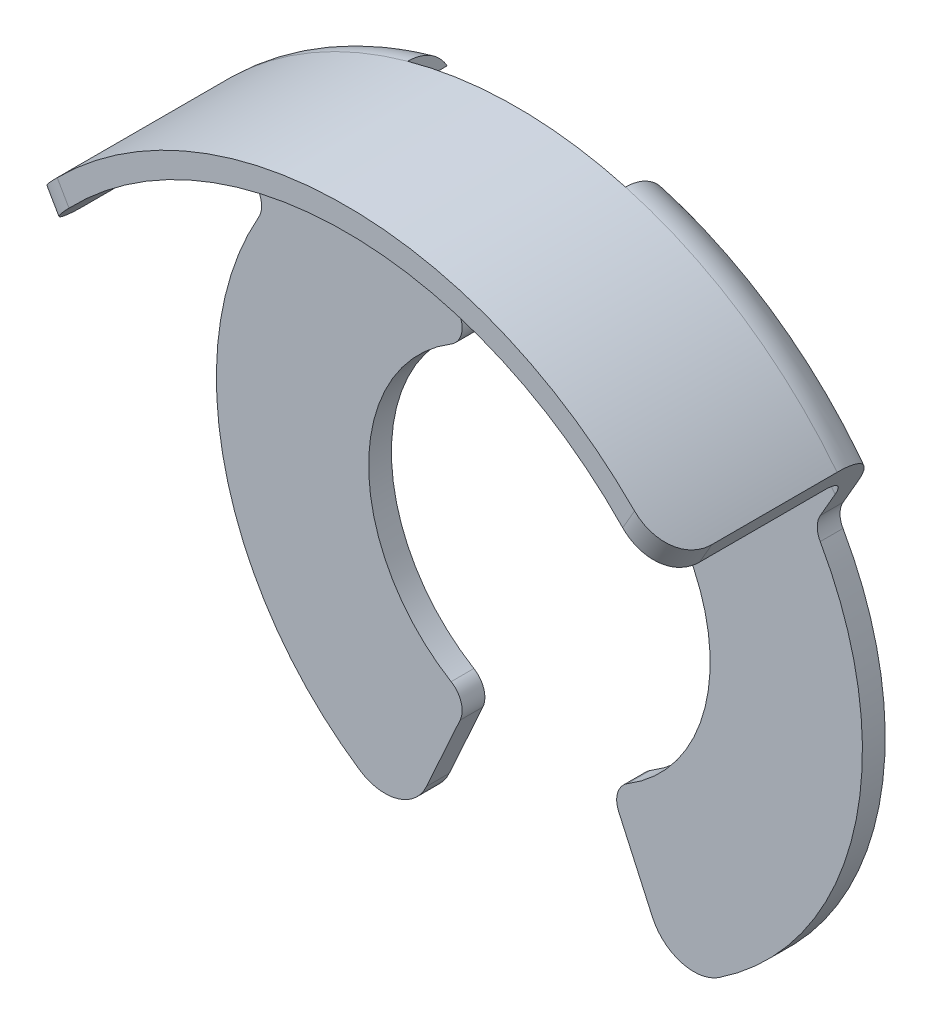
ISO-10303-21;
HEADER;
FILE_DESCRIPTION(('STEP AP214'),'2;1');
FILE_NAME('part.step','',(''),(''),'','','');
FILE_SCHEMA(('AUTOMOTIVE_DESIGN { 1 0 10303 214 1 1 1 1 }'));
ENDSEC;
DATA;
#1=APPLICATION_CONTEXT('core data for automotive mechanical design processes');
#2=APPLICATION_PROTOCOL_DEFINITION('international standard','automotive_design',2000,#1);
#3=PRODUCT_CONTEXT('',#1,'mechanical');
#4=PRODUCT('Part','Part','',(#3));
#5=PRODUCT_RELATED_PRODUCT_CATEGORY('part','',(#4));
#6=PRODUCT_DEFINITION_FORMATION('','',#4);
#7=PRODUCT_DEFINITION_CONTEXT('part definition',#1,'design');
#8=PRODUCT_DEFINITION('design','',#6,#7);
#9=PRODUCT_DEFINITION_SHAPE('','',#8);
#10=(LENGTH_UNIT() NAMED_UNIT(*) SI_UNIT(.MILLI.,.METRE.));
#11=(NAMED_UNIT(*) PLANE_ANGLE_UNIT() SI_UNIT($,.RADIAN.));
#12=(NAMED_UNIT(*) SI_UNIT($,.STERADIAN.) SOLID_ANGLE_UNIT());
#13=UNCERTAINTY_MEASURE_WITH_UNIT(LENGTH_MEASURE(1.E-05),#10,'distance_accuracy_value','');
#14=(GEOMETRIC_REPRESENTATION_CONTEXT(3) GLOBAL_UNCERTAINTY_ASSIGNED_CONTEXT((#13)) GLOBAL_UNIT_ASSIGNED_CONTEXT((#10,
#11,#12)) REPRESENTATION_CONTEXT('',''));
#15=CARTESIAN_POINT('',(0.,0.,0.));
#16=DIRECTION('',(0.,0.,1.));
#17=DIRECTION('',(1.,0.,0.));
#18=AXIS2_PLACEMENT_3D('',#15,#16,#17);
#19=CARTESIAN_POINT('',(0.,0.,-6.8));
#20=DIRECTION('',(0.,0.,1.));
#21=DIRECTION('',(1.,0.,0.));
#22=AXIS2_PLACEMENT_3D('',#19,#20,#21);
#23=CYLINDRICAL_SURFACE('',#22,13.5);
#24=DIRECTION('',(0.,0.,1.));
#25=VECTOR('',#24,1.);
#26=CARTESIAN_POINT('',(3.82707219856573,12.9461777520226,-6.8));
#27=LINE('',#26,#25);
#28=CARTESIAN_POINT('',(3.82707219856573,12.9461777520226,-7.3856406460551));
#29=VERTEX_POINT('',#28);
#30=CARTESIAN_POINT('',(3.82707219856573,12.9461777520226,-6.));
#31=VERTEX_POINT('',#30);
#32=EDGE_CURVE('E261',#29,#31,#27,.T.);
#33=ORIENTED_EDGE('',*,*,#32,.F.);
#34=CARTESIAN_POINT('',(0.,0.,-7.3856406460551));
#35=DIRECTION('',(0.,0.,1.));
#36=DIRECTION('',(1.,0.,0.));
#37=AXIS2_PLACEMENT_3D('',#34,#35,#36);
#38=CIRCLE('',#37,13.5);
#39=CARTESIAN_POINT('',(3.86808634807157,12.9339826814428,-7.3856406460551));
#40=VERTEX_POINT('',#39);
#41=EDGE_CURVE('E703',#29,#40,#38,.F.);
#42=ORIENTED_EDGE('',*,*,#41,.T.);
#43=DIRECTION('',(0.,0.,1.));
#44=VECTOR('',#43,1.);
#45=CARTESIAN_POINT('',(3.86808634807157,12.9339826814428,-7.6));
#46=LINE('',#45,#44);
#47=CARTESIAN_POINT('',(3.86808634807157,12.9339826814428,-6.));
#48=VERTEX_POINT('',#47);
#49=EDGE_CURVE('E69',#40,#48,#46,.T.);
#50=ORIENTED_EDGE('',*,*,#49,.T.);
#51=CARTESIAN_POINT('',(0.,0.,-6.));
#52=DIRECTION('',(0.,0.,1.));
#53=DIRECTION('',(1.,0.,0.));
#54=AXIS2_PLACEMENT_3D('',#51,#52,#53);
#55=CIRCLE('',#54,13.5);
#56=CARTESIAN_POINT('',(10.8264489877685,8.06461420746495,-6.));
#57=VERTEX_POINT('',#56);
#58=EDGE_CURVE('E603',#48,#57,#55,.F.);
#59=ORIENTED_EDGE('',*,*,#58,.T.);
#60=DIRECTION('',(0.,0.,1.));
#61=VECTOR('',#60,1.);
#62=CARTESIAN_POINT('',(10.8264489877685,8.06461420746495,-6.8));
#63=LINE('',#62,#61);
#64=CARTESIAN_POINT('',(10.8264489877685,8.06461420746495,-1.6));
#65=VERTEX_POINT('',#64);
#66=EDGE_CURVE('E410',#57,#65,#63,.T.);
#67=ORIENTED_EDGE('',*,*,#66,.T.);
#68=CARTESIAN_POINT('',(10.8264489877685,8.06461420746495,-1.6));
#69=CARTESIAN_POINT('',(10.8264493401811,8.06461164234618,-1.55739513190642));
#70=CARTESIAN_POINT('',(10.8253413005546,8.06610144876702,-1.51481200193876));
#71=CARTESIAN_POINT('',(10.820924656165,8.07202638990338,-1.42997703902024));
#72=CARTESIAN_POINT('',(10.817616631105,8.07646074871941,-1.38772512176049));
#73=CARTESIAN_POINT('',(10.804452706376,8.09407365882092,-1.26221380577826));
#74=CARTESIAN_POINT('',(10.7913566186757,8.11156277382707,-1.1798390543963));
#75=CARTESIAN_POINT('',(10.7569482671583,8.157135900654,-1.02000219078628));
#76=CARTESIAN_POINT('',(10.7356404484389,8.18521418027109,-0.942537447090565));
#77=CARTESIAN_POINT('',(10.6854100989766,8.25067926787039,-0.794261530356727));
#78=CARTESIAN_POINT('',(10.6564830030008,8.2880716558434,-0.723454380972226));
#79=CARTESIAN_POINT('',(10.590443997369,8.37230339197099,-0.587387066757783));
#80=CARTESIAN_POINT('',(10.5530523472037,8.41945928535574,-0.522459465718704));
#81=CARTESIAN_POINT('',(10.4716632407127,8.52047384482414,-0.4027474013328));
#82=CARTESIAN_POINT('',(10.4276633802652,8.57433494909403,-0.347966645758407));
#83=CARTESIAN_POINT('',(10.3305174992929,8.69117847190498,-0.245972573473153));
#84=CARTESIAN_POINT('',(10.2769379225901,8.75453988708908,-0.19960568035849));
#85=CARTESIAN_POINT('',(10.1643781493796,8.88497816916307,-0.120756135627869));
#86=CARTESIAN_POINT('',(10.1053987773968,8.95205446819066,-0.0882713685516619));
#87=CARTESIAN_POINT('',(9.99376579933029,9.07636292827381,-0.0422800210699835));
#88=CARTESIAN_POINT('',(9.94174476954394,9.13332682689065,-0.0264839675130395));
#89=CARTESIAN_POINT('',(9.83579219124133,9.24734322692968,-0.00533864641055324));
#90=CARTESIAN_POINT('',(9.78186187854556,9.3043956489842,1.7257257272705E-05));
#91=CARTESIAN_POINT('',(9.7273858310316,9.36098097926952,0.));
#92=B_SPLINE_CURVE_WITH_KNOTS('',3,(#68,#69,#70,#71,#72,#73,#74,#75,#76,#77,#78,#79,#80,#81,#82,
#83,#84,#85,#86,#87,#88,#89,#90,#91),.UNSPECIFIED.,.F.,.F.,(4,2,2,2,2,2,2,2,2,2,2,4),(0.,
0.127731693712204,0.255429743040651,0.509760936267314,0.763954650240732,1.01830101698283,
1.28276200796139,1.54731944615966,1.83122481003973,2.11508689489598,2.35062110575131,
2.58600555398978),.UNSPECIFIED.);
#93=CARTESIAN_POINT('',(9.7273858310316,9.36098097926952,0.));
#94=VERTEX_POINT('',#93);
#95=EDGE_CURVE('E464',#65,#94,#92,.T.);
#96=ORIENTED_EDGE('',*,*,#95,.T.);
#97=CARTESIAN_POINT('',(0.,0.,0.));
#98=DIRECTION('',(0.,0.,1.));
#99=DIRECTION('',(1.,0.,0.));
#100=AXIS2_PLACEMENT_3D('',#97,#98,#99);
#101=CIRCLE('',#100,13.5);
#102=CARTESIAN_POINT('',(-9.7273858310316,9.36098097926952,0.));
#103=VERTEX_POINT('',#102);
#104=EDGE_CURVE('E396',#94,#103,#101,.T.);
#105=ORIENTED_EDGE('',*,*,#104,.T.);
#106=CARTESIAN_POINT('',(-9.7273858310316,9.36098097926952,0.));
#107=CARTESIAN_POINT('',(-9.76148303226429,9.32555133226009,-1.187197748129E-06));
#108=CARTESIAN_POINT('',(-9.79536599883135,9.28995203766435,-0.00209345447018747));
#109=CARTESIAN_POINT('',(-9.86249970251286,9.21864909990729,-0.0104064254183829));
#110=CARTESIAN_POINT('',(-9.89575053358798,9.18294547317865,-0.0166265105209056));
#111=CARTESIAN_POINT('',(-9.99417476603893,9.07611181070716,-0.0413763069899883));
#112=CARTESIAN_POINT('',(-10.0581141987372,9.00516088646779,-0.0659958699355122));
#113=CARTESIAN_POINT('',(-10.1809427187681,8.86606109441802,-0.130689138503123));
#114=CARTESIAN_POINT('',(-10.2398317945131,8.7979122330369,-0.170762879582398));
#115=CARTESIAN_POINT('',(-10.3512232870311,8.66657890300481,-0.265377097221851));
#116=CARTESIAN_POINT('',(-10.4037256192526,8.60339450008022,-0.319917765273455));
#117=CARTESIAN_POINT('',(-10.5010743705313,8.48430099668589,-0.442233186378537));
#118=CARTESIAN_POINT('',(-10.5459197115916,8.42839292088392,-0.510009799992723));
#119=CARTESIAN_POINT('',(-10.6267454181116,8.326255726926,-0.657208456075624));
#120=CARTESIAN_POINT('',(-10.6627264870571,8.28002584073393,-0.73662957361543));
#121=CARTESIAN_POINT('',(-10.7231135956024,8.20165639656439,-0.90068068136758));
#122=CARTESIAN_POINT('',(-10.748012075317,8.16892357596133,-0.984845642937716));
#123=CARTESIAN_POINT('',(-10.7879072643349,8.11616709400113,-1.15922129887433));
#124=CARTESIAN_POINT('',(-10.8029216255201,8.09612077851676,-1.24942089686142));
#125=CARTESIAN_POINT('',(-10.8172872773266,8.07690194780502,-1.38380644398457));
#126=CARTESIAN_POINT('',(-10.8207214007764,8.0722988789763,-1.42686869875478));
#127=CARTESIAN_POINT('',(-10.8253006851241,8.06615606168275,-1.51327892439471));
#128=CARTESIAN_POINT('',(-10.8264486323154,8.06461258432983,-1.55662648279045));
#129=CARTESIAN_POINT('',(-10.8264489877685,8.06461420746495,-1.6));
#130=B_SPLINE_CURVE_WITH_KNOTS('',3,(#106,#107,#108,#109,#110,#111,#112,#113,#114,#115,#116,
#117,#118,#119,#120,#121,#122,#123,#124,#125,#126,#127,#128,#129),.UNSPECIFIED.,.F.,.F.,(4,2,2,
2,2,2,2,2,2,2,2,4),(0.,0.147419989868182,0.29481789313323,0.589210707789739,0.8836041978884,
1.17800158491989,1.47244038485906,1.7668558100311,2.04641579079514,2.32547514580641,
2.45566098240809,2.58568805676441),.UNSPECIFIED.);
#131=CARTESIAN_POINT('',(-10.8264489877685,8.06461420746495,-1.6));
#132=VERTEX_POINT('',#131);
#133=EDGE_CURVE('E455',#103,#132,#130,.T.);
#134=ORIENTED_EDGE('',*,*,#133,.T.);
#135=DIRECTION('',(0.,0.,1.));
#136=VECTOR('',#135,1.);
#137=CARTESIAN_POINT('',(-10.8264489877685,8.06461420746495,-6.8));
#138=LINE('',#137,#136);
#139=CARTESIAN_POINT('',(-10.8264489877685,8.06461420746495,-6.));
#140=VERTEX_POINT('',#139);
#141=EDGE_CURVE('E417',#132,#140,#138,.F.);
#142=ORIENTED_EDGE('',*,*,#141,.T.);
#143=CARTESIAN_POINT('',(0.,0.,-6.));
#144=DIRECTION('',(0.,0.,1.));
#145=DIRECTION('',(1.,0.,0.));
#146=AXIS2_PLACEMENT_3D('',#143,#144,#145);
#147=CIRCLE('',#146,13.5);
#148=CARTESIAN_POINT('',(-3.86808634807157,12.9339826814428,-6.));
#149=VERTEX_POINT('',#148);
#150=EDGE_CURVE('E599',#140,#149,#147,.F.);
#151=ORIENTED_EDGE('',*,*,#150,.T.);
#152=DIRECTION('',(0.,0.,1.));
#153=VECTOR('',#152,1.);
#154=CARTESIAN_POINT('',(-3.86808634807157,12.9339826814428,-7.6));
#155=LINE('',#154,#153);
#156=CARTESIAN_POINT('',(-3.86808634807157,12.9339826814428,-7.3856406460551));
#157=VERTEX_POINT('',#156);
#158=EDGE_CURVE('E348',#157,#149,#155,.T.);
#159=ORIENTED_EDGE('',*,*,#158,.F.);
#160=CARTESIAN_POINT('',(-3.82707219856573,12.9461777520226,-7.3856406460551));
#161=VERTEX_POINT('',#160);
#162=EDGE_CURVE('E695',#157,#161,#38,.F.);
#163=ORIENTED_EDGE('',*,*,#162,.T.);
#164=DIRECTION('',(0.,0.,1.));
#165=VECTOR('',#164,1.);
#166=CARTESIAN_POINT('',(-3.82707219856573,12.9461777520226,-6.8));
#167=LINE('',#166,#165);
#168=CARTESIAN_POINT('',(-3.82707219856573,12.9461777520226,-6.));
#169=VERTEX_POINT('',#168);
#170=EDGE_CURVE('E269',#169,#161,#167,.F.);
#171=ORIENTED_EDGE('',*,*,#170,.F.);
#172=CARTESIAN_POINT('',(0.,0.,-6.));
#173=DIRECTION('',(0.,0.,-1.));
#174=DIRECTION('',(-1.,0.,0.));
#175=AXIS2_PLACEMENT_3D('',#172,#173,#174);
#176=CIRCLE('',#175,13.5);
#177=EDGE_CURVE('E273',#31,#169,#176,.F.);
#178=ORIENTED_EDGE('',*,*,#177,.F.);
#179=EDGE_LOOP('',(#33,#42,#50,#59,#67,#96,#105,#134,#142,#151,#159,#163,#171,#178));
#180=FACE_BOUND('',#179,.T.);
#181=ADVANCED_FACE('F39',(#180),#23,.F.);
#182=CARTESIAN_POINT('',(0.,0.,-6.));
#183=DIRECTION('',(0.,0.,1.));
#184=DIRECTION('',(1.,0.,0.));
#185=AXIS2_PLACEMENT_3D('',#182,#183,#184);
#186=TOROIDAL_SURFACE('',#185,12.7,1.6);
#187=ORIENTED_EDGE('',*,*,#41,.F.);
#188=CARTESIAN_POINT('',(3.82707219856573,10.6457171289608,-6.79716465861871));
#189=CARTESIAN_POINT('',(3.82707219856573,10.694166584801,-6.87649861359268));
#190=CARTESIAN_POINT('',(3.82707219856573,10.7496632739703,-6.95163648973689));
#191=CARTESIAN_POINT('',(3.82707219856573,10.8726821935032,-7.09146209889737));
#192=CARTESIAN_POINT('',(3.82707219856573,10.9402275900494,-7.15612923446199));
#193=CARTESIAN_POINT('',(3.82707219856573,11.0848653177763,-7.27324096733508));
#194=CARTESIAN_POINT('',(3.82707219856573,11.1619302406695,-7.32571945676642));
#195=CARTESIAN_POINT('',(3.82707219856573,11.3234597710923,-7.41755701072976));
#196=CARTESIAN_POINT('',(3.82707219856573,11.4079221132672,-7.45692007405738));
#197=CARTESIAN_POINT('',(3.82707219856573,11.5854954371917,-7.52306047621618));
#198=CARTESIAN_POINT('',(3.82707219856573,11.6788170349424,-7.54927297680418));
#199=CARTESIAN_POINT('',(3.82707219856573,11.8685037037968,-7.58609302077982));
#200=CARTESIAN_POINT('',(3.82707219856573,11.9648695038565,-7.59669679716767));
#201=CARTESIAN_POINT('',(3.82707219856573,12.1604569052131,-7.60204988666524));
#202=CARTESIAN_POINT('',(3.82707219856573,12.2596898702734,-7.59639786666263));
#203=CARTESIAN_POINT('',(3.82707219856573,12.4557761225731,-7.56837033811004));
#204=CARTESIAN_POINT('',(3.82707219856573,12.552629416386,-7.54599487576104));
#205=CARTESIAN_POINT('',(3.82707219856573,12.7402298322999,-7.48518563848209));
#206=CARTESIAN_POINT('',(3.82707219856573,12.8310231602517,-7.44689480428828));
#207=CARTESIAN_POINT('',(3.82707219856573,13.0045760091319,-7.35510309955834));
#208=CARTESIAN_POINT('',(3.82707219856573,13.0873369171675,-7.30160486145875));
#209=CARTESIAN_POINT('',(3.82707219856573,13.2394645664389,-7.18277126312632));
#210=CARTESIAN_POINT('',(3.82707219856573,13.3091860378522,-7.11789033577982));
#211=CARTESIAN_POINT('',(3.82707219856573,13.436171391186,-6.97690111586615));
#212=CARTESIAN_POINT('',(3.82707219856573,13.4934383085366,-6.90079556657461));
#213=CARTESIAN_POINT('',(3.82707219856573,13.5914101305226,-6.74288364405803));
#214=CARTESIAN_POINT('',(3.82707219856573,13.6326971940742,-6.6614383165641));
#215=CARTESIAN_POINT('',(3.82707219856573,13.7004836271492,-6.49261027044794));
#216=CARTESIAN_POINT('',(3.82707219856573,13.7269861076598,-6.4052288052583));
#217=CARTESIAN_POINT('',(3.82707219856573,13.7636435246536,-6.23007108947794));
#218=CARTESIAN_POINT('',(3.82707219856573,13.7743014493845,-6.14239983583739));
#219=CARTESIAN_POINT('',(3.82707219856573,13.7805166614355,-5.96652761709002));
#220=CARTESIAN_POINT('',(3.82707219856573,13.7760755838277,-5.8783267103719));
#221=CARTESIAN_POINT('',(3.82707219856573,13.752417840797,-5.70519371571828));
#222=CARTESIAN_POINT('',(3.82707219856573,13.7334083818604,-5.62023317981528));
#223=CARTESIAN_POINT('',(3.82707219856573,13.6814999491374,-5.45467372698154));
#224=CARTESIAN_POINT('',(3.82707219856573,13.6486008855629,-5.37407483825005));
#225=CARTESIAN_POINT('',(3.82707219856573,13.5696774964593,-5.21881142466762));
#226=CARTESIAN_POINT('',(3.82707219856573,13.5235543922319,-5.14419718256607));
#227=CARTESIAN_POINT('',(3.82707219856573,13.4197409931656,-5.00351360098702));
#228=CARTESIAN_POINT('',(3.82707219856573,13.3620494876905,-4.93744515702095));
#229=CARTESIAN_POINT('',(3.82707219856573,13.2351488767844,-4.81380507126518));
#230=CARTESIAN_POINT('',(3.82707219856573,13.1656742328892,-4.75650617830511));
#231=CARTESIAN_POINT('',(3.82707219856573,13.0183906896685,-4.65388045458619));
#232=CARTESIAN_POINT('',(3.82707219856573,12.9405803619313,-4.60855568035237));
#233=CARTESIAN_POINT('',(3.82707219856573,12.7756816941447,-4.52932217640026));
#234=CARTESIAN_POINT('',(3.82707219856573,12.6883528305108,-4.49591411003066));
#235=CARTESIAN_POINT('',(3.82707219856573,12.5094500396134,-4.44363175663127));
#236=CARTESIAN_POINT('',(3.82707219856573,12.4178752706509,-4.42476036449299));
#237=CARTESIAN_POINT('',(3.82707219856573,12.2293717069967,-4.40140387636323));
#238=CARTESIAN_POINT('',(3.82707219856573,12.1323716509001,-4.39749229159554));
#239=CARTESIAN_POINT('',(3.82707219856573,11.939035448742,-4.40561432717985));
#240=CARTESIAN_POINT('',(3.82707219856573,11.8426994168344,-4.41765062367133));
#241=CARTESIAN_POINT('',(3.82707219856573,11.6511282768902,-4.45779563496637));
#242=CARTESIAN_POINT('',(3.82707219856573,11.5559683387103,-4.48626451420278));
#243=CARTESIAN_POINT('',(3.82707219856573,11.3718124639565,-4.55887908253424));
#244=CARTESIAN_POINT('',(3.82707219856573,11.2828168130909,-4.60302549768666));
#245=CARTESIAN_POINT('',(3.82707219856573,11.1143446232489,-4.70561144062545));
#246=CARTESIAN_POINT('',(3.82707219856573,11.0348039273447,-4.76394534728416));
#247=CARTESIAN_POINT('',(3.82707219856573,10.8871796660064,-4.89367450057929));
#248=CARTESIAN_POINT('',(3.82707219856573,10.819093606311,-4.96506689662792));
#249=CARTESIAN_POINT('',(3.82707219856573,10.6995163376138,-5.11577860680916));
#250=CARTESIAN_POINT('',(3.82707219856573,10.6474492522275,-5.19464033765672));
#251=CARTESIAN_POINT('',(3.82707219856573,10.5582695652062,-5.36040726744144));
#252=CARTESIAN_POINT('',(3.82707219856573,10.5211500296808,-5.44730871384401));
#253=CARTESIAN_POINT('',(3.82707219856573,10.4651880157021,-5.62115563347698));
#254=CARTESIAN_POINT('',(3.82707219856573,10.4453964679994,-5.70779605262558));
#255=CARTESIAN_POINT('',(3.82707219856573,10.4213216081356,-5.88322658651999));
#256=CARTESIAN_POINT('',(3.82707219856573,10.4170382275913,-5.97201669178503));
#257=CARTESIAN_POINT('',(3.82707219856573,10.4240193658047,-6.14540496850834));
#258=CARTESIAN_POINT('',(3.82707219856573,10.4346702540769,-6.23002902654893));
#259=CARTESIAN_POINT('',(3.82707219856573,10.4699983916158,-6.39620911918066));
#260=CARTESIAN_POINT('',(3.82707219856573,10.4946567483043,-6.47776912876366));
#261=CARTESIAN_POINT('',(3.82707219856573,10.5422843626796,-6.5984019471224));
#262=CARTESIAN_POINT('',(3.82707219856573,10.5605742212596,-6.63938532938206));
#263=CARTESIAN_POINT('',(3.82707219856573,10.6006016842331,-6.71962625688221));
#264=CARTESIAN_POINT('',(3.82707219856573,10.6223389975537,-6.75888394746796));
#265=CARTESIAN_POINT('',(3.82707219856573,10.6457171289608,-6.79716465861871));
#266=B_SPLINE_CURVE_WITH_KNOTS('',3,(#188,#189,#190,#191,#192,#193,#194,#195,#196,#197,#198,
#199,#200,#201,#202,#203,#204,#205,#206,#207,#208,#209,#210,#211,#212,#213,#214,#215,#216,#217,
#218,#219,#220,#221,#222,#223,#224,#225,#226,#227,#228,#229,#230,#231,#232,#233,#234,#235,#236,
#237,#238,#239,#240,#241,#242,#243,#244,#245,#246,#247,#248,#249,#250,#251,#252,#253,#254,#255,
#256,#257,#258,#259,#260,#261,#262,#263,#264,#265),.UNSPECIFIED.,.T.,.F.,(4,2,2,2,2,2,2,2,2,2,2,
2,2,2,2,2,2,2,2,2,2,2,2,2,2,2,2,2,2,2,2,2,2,2,2,2,2,2,4),(0.,0.278700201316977,
0.557942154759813,0.836398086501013,1.11476904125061,1.40424702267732,1.69379485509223,
1.99055211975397,2.28730856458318,2.58145544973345,2.87555144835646,3.15983623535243,
3.44405165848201,3.71662904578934,3.98914905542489,4.25281800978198,4.5164584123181,
4.77641708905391,5.0363774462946,5.29833259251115,5.56031516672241,5.82926618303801,
6.0982633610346,6.37750785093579,6.65680793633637,6.94671403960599,7.23666879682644,
7.5332339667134,7.82981287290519,8.12424802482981,8.41861897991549,8.70065350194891,
8.98255704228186,9.24782957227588,9.51310093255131,9.7677864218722,10.0221292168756,
10.1566207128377,10.2911008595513),.UNSPECIFIED.);
#267=CARTESIAN_POINT('',(3.82707219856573,13.7783713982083,-6.));
#268=VERTEX_POINT('',#267);
#269=EDGE_CURVE('E11',#29,#268,#266,.T.);
#270=ORIENTED_EDGE('',*,*,#269,.T.);
#271=CARTESIAN_POINT('',(0.,0.,-6.));
#272=DIRECTION('',(0.,0.,1.));
#273=DIRECTION('',(1.,0.,0.));
#274=AXIS2_PLACEMENT_3D('',#271,#272,#273);
#275=CIRCLE('',#274,14.3);
#276=CARTESIAN_POINT('',(11.2597839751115,8.81517242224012,-6.));
#277=VERTEX_POINT('',#276);
#278=EDGE_CURVE('E690',#277,#268,#275,.T.);
#279=ORIENTED_EDGE('',*,*,#278,.F.);
#280=CARTESIAN_POINT('',(10.3882936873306,7.30570696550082,-7.6));
#281=CARTESIAN_POINT('',(10.4146636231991,7.35138103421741,-7.59999710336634));
#282=CARTESIAN_POINT('',(10.4410224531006,7.3970358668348,-7.59785271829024));
#283=CARTESIAN_POINT('',(10.4935698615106,7.48805064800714,-7.58924940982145));
#284=CARTESIAN_POINT('',(10.5197583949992,7.53341051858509,-7.58278938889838));
#285=CARTESIAN_POINT('',(10.5979224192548,7.66879457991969,-7.55685820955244));
#286=CARTESIAN_POINT('',(10.6493976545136,7.7579523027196,-7.53083568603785));
#287=CARTESIAN_POINT('',(10.7494458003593,7.93124077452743,-7.46143716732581));
#288=CARTESIAN_POINT('',(10.7980126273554,8.01536098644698,-7.41802616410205));
#289=CARTESIAN_POINT('',(10.8904334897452,8.17543861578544,-7.31451153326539));
#290=CARTESIAN_POINT('',(10.9342938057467,8.25140691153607,-7.25443054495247));
#291=CARTESIAN_POINT('',(11.013114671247,8.38792865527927,-7.12302703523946));
#292=CARTESIAN_POINT('',(11.048455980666,8.4491415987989,-7.05261947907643));
#293=CARTESIAN_POINT('',(11.1120804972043,8.55934249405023,-6.89995145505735));
#294=CARTESIAN_POINT('',(11.1403639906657,8.60833094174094,-6.81769146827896));
#295=CARTESIAN_POINT('',(11.1865547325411,8.68833565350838,-6.65115951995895));
#296=CARTESIAN_POINT('',(11.2051303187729,8.7205095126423,-6.56762665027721));
#297=CARTESIAN_POINT('',(11.2344527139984,8.7712973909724,-6.39530558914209));
#298=CARTESIAN_POINT('',(11.2452136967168,8.78993595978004,-6.30652722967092));
#299=CARTESIAN_POINT('',(11.2544858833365,8.80599585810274,-6.18076197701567));
#300=CARTESIAN_POINT('',(11.2564725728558,8.80943690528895,-6.1446953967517));
#301=CARTESIAN_POINT('',(11.2591201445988,8.81402263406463,-6.07242547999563));
#302=CARTESIAN_POINT('',(11.2597831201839,8.81517094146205,-6.03622245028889));
#303=CARTESIAN_POINT('',(11.2597839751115,8.81517242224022,-6.00000000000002));
#304=B_SPLINE_CURVE_WITH_KNOTS('',3,(#280,#281,#282,#283,#284,#285,#286,#287,#288,#289,#290,
#291,#292,#293,#294,#295,#296,#297,#298,#299,#300,#301,#302,#303),.UNSPECIFIED.,.F.,.F.,(4,2,2,
2,2,2,2,2,2,2,2,4),(0.,0.158129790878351,0.316299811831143,0.633224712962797,0.950790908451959,
1.26792791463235,1.56562282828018,1.86330566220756,2.1361782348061,2.40855464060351,
2.51733132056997,2.62593584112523),.UNSPECIFIED.);
#305=CARTESIAN_POINT('',(10.3882936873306,7.30570696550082,-7.6));
#306=VERTEX_POINT('',#305);
#307=EDGE_CURVE('E524',#306,#277,#304,.T.);
#308=ORIENTED_EDGE('',*,*,#307,.F.);
#309=CARTESIAN_POINT('',(0.,0.,-7.6));
#310=DIRECTION('',(0.,0.,1.));
#311=DIRECTION('',(1.,0.,0.));
#312=AXIS2_PLACEMENT_3D('',#309,#310,#311);
#313=CIRCLE('',#312,12.7);
#314=CARTESIAN_POINT('',(4.98501434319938,11.6807376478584,-7.6));
#315=VERTEX_POINT('',#314);
#316=EDGE_CURVE('E706',#315,#306,#313,.F.);
#317=ORIENTED_EDGE('',*,*,#316,.F.);
#318=CARTESIAN_POINT('',(3.86808634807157,12.9339826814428,-7.3856406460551));
#319=CARTESIAN_POINT('',(3.90936385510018,12.9216455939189,-7.38562385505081));
#320=CARTESIAN_POINT('',(3.95013134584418,12.9076300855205,-7.38652580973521));
#321=CARTESIAN_POINT('',(4.0303166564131,12.8764009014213,-7.39004126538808));
#322=CARTESIAN_POINT('',(4.06973534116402,12.859189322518,-7.39265364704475));
#323=CARTESIAN_POINT('',(4.14672973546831,12.8218161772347,-7.39944504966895));
#324=CARTESIAN_POINT('',(4.18431461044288,12.8016718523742,-7.40361512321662));
#325=CARTESIAN_POINT('',(4.2576272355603,12.7585415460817,-7.41329627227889));
#326=CARTESIAN_POINT('',(4.29335474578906,12.7355551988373,-7.41880752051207));
#327=CARTESIAN_POINT('',(4.39726284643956,12.6627108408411,-7.43692645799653));
#328=CARTESIAN_POINT('',(4.4624149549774,12.6088472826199,-7.45114402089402));
#329=CARTESIAN_POINT('',(4.58335712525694,12.4917174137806,-7.48136126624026));
#330=CARTESIAN_POINT('',(4.63912412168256,12.4284286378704,-7.49736518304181));
#331=CARTESIAN_POINT('',(4.74383172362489,12.2888200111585,-7.52951511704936));
#332=CARTESIAN_POINT('',(4.79198216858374,12.2118875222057,-7.54558700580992));
#333=CARTESIAN_POINT('',(4.87473238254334,12.0504471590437,-7.57301459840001));
#334=CARTESIAN_POINT('',(4.90937645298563,11.9659651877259,-7.58438572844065));
#335=CARTESIAN_POINT('',(4.94676662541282,11.8465117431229,-7.59426797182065));
#336=CARTESIAN_POINT('',(4.95588656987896,11.8137417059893,-7.59637119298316));
#337=CARTESIAN_POINT('',(4.97203201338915,11.7476316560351,-7.59923706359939));
#338=CARTESIAN_POINT('',(4.97905741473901,11.714291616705,-7.59999965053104));
#339=CARTESIAN_POINT('',(4.98501434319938,11.6807376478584,-7.6));
#340=B_SPLINE_CURVE_WITH_KNOTS('',3,(#318,#319,#320,#321,#322,#323,#324,#325,#326,#327,#328,
#329,#330,#331,#332,#333,#334,#335,#336,#337,#338,#339),.UNSPECIFIED.,.F.,.F.,(4,2,2,2,2,2,2,2,
2,2,4),(0.,0.129187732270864,0.258291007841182,0.386663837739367,0.515053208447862,
0.771017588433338,1.02760213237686,1.30282554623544,1.57713846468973,1.67930076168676,
1.78146782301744),.UNSPECIFIED.);
#341=EDGE_CURVE('E693',#40,#315,#340,.T.);
#342=ORIENTED_EDGE('',*,*,#341,.F.);
#343=EDGE_LOOP('',(#187,#270,#279,#308,#317,#342));
#344=FACE_BOUND('',#343,.T.);
#345=ADVANCED_FACE('F481',(#344),#186,.T.);
#346=CARTESIAN_POINT('',(-3.82707219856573,13.7783713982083,-6.));
#347=VERTEX_POINT('',#346);
#348=CARTESIAN_POINT('',(-11.2597839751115,8.81517242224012,-6.));
#349=VERTEX_POINT('',#348);
#350=EDGE_CURVE('E691',#347,#349,#275,.T.);
#351=ORIENTED_EDGE('',*,*,#350,.F.);
#352=CARTESIAN_POINT('',(-3.82707219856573,10.6457171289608,-6.79716465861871));
#353=CARTESIAN_POINT('',(-3.82707219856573,10.6008853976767,-6.72374037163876));
#354=CARTESIAN_POINT('',(-3.82707219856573,10.562023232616,-6.64662136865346));
#355=CARTESIAN_POINT('',(-3.82707219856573,10.4976611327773,-6.48694258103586));
#356=CARTESIAN_POINT('',(-3.82707219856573,10.4721687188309,-6.40437976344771));
#357=CARTESIAN_POINT('',(-3.82707219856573,10.4355456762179,-6.23602372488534));
#358=CARTESIAN_POINT('',(-3.82707219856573,10.4244296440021,-6.1502273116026));
#359=CARTESIAN_POINT('',(-3.82707219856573,10.4170726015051,-5.97801224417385));
#360=CARTESIAN_POINT('',(-3.82707219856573,10.4208287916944,-5.89159371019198));
#361=CARTESIAN_POINT('',(-3.82707219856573,10.4428475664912,-5.72223212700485));
#362=CARTESIAN_POINT('',(-3.82707219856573,10.4608458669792,-5.63925447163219));
#363=CARTESIAN_POINT('',(-3.82707219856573,10.510318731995,-5.47742865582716));
#364=CARTESIAN_POINT('',(-3.82707219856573,10.5417941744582,-5.39858076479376));
#365=CARTESIAN_POINT('',(-3.82707219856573,10.6176466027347,-5.24589081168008));
#366=CARTESIAN_POINT('',(-3.82707219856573,10.6622102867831,-5.17214173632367));
#367=CARTESIAN_POINT('',(-3.82707219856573,10.762538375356,-5.03271464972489));
#368=CARTESIAN_POINT('',(-3.82707219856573,10.8183050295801,-4.9670382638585));
#369=CARTESIAN_POINT('',(-3.82707219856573,10.9423238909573,-4.84216373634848));
#370=CARTESIAN_POINT('',(-3.82707219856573,11.0110537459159,-4.78344026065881));
#371=CARTESIAN_POINT('',(-3.82707219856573,11.1569518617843,-4.67763585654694));
#372=CARTESIAN_POINT('',(-3.82707219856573,11.234122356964,-4.6305580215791));
#373=CARTESIAN_POINT('',(-3.82707219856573,11.3993105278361,-4.54669753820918));
#374=CARTESIAN_POINT('',(-3.82707219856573,11.4876926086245,-4.51063190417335));
#375=CARTESIAN_POINT('',(-3.82707219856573,11.6691289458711,-4.45326532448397));
#376=CARTESIAN_POINT('',(-3.82707219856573,11.7621842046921,-4.43196756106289));
#377=CARTESIAN_POINT('',(-3.82707219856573,11.9538825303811,-4.40414027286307));
#378=CARTESIAN_POINT('',(-3.82707219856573,12.0526065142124,-4.39816465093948));
#379=CARTESIAN_POINT('',(-3.82707219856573,12.2496726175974,-4.40281417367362));
#380=CARTESIAN_POINT('',(-3.82707219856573,12.3480147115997,-4.41344041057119));
#381=CARTESIAN_POINT('',(-3.82707219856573,12.541753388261,-4.45123184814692));
#382=CARTESIAN_POINT('',(-3.82707219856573,12.6371415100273,-4.47844063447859));
#383=CARTESIAN_POINT('',(-3.82707219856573,12.821800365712,-4.54891694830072));
#384=CARTESIAN_POINT('',(-3.82707219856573,12.9110718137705,-4.5921825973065));
#385=CARTESIAN_POINT('',(-3.82707219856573,13.0783629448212,-4.69242006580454));
#386=CARTESIAN_POINT('',(-3.82707219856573,13.1566179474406,-4.74899868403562));
#387=CARTESIAN_POINT('',(-3.82707219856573,13.3020059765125,-4.87499977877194));
#388=CARTESIAN_POINT('',(-3.82707219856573,13.3691415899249,-4.94441925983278));
#389=CARTESIAN_POINT('',(-3.82707219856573,13.4874839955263,-5.09112503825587));
#390=CARTESIAN_POINT('',(-3.82707219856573,13.5392238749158,-5.16798131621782));
#391=CARTESIAN_POINT('',(-3.82707219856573,13.6284840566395,-5.32955151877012));
#392=CARTESIAN_POINT('',(-3.82707219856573,13.6660076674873,-5.41426360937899));
#393=CARTESIAN_POINT('',(-3.82707219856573,13.724376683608,-5.58575479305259));
#394=CARTESIAN_POINT('',(-3.82707219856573,13.7457871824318,-5.67234181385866));
#395=CARTESIAN_POINT('',(-3.82707219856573,13.7734169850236,-5.84790386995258));
#396=CARTESIAN_POINT('',(-3.82707219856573,13.7796385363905,-5.93687854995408));
#397=CARTESIAN_POINT('',(-3.82707219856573,13.7767064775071,-6.11268191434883));
#398=CARTESIAN_POINT('',(-3.82707219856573,13.7678753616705,-6.19951617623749));
#399=CARTESIAN_POINT('',(-3.82707219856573,13.7357555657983,-6.3704623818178));
#400=CARTESIAN_POINT('',(-3.82707219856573,13.7124673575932,-6.45457441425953));
#401=CARTESIAN_POINT('',(-3.82707219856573,13.6522066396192,-6.61774650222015));
#402=CARTESIAN_POINT('',(-3.82707219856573,13.6152324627,-6.69680594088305));
#403=CARTESIAN_POINT('',(-3.82707219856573,13.5287924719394,-6.84776346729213));
#404=CARTESIAN_POINT('',(-3.82707219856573,13.4793257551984,-6.91966103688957));
#405=CARTESIAN_POINT('',(-3.82707219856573,13.3682854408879,-7.05588870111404));
#406=CARTESIAN_POINT('',(-3.82707219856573,13.3064836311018,-7.1200326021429));
#407=CARTESIAN_POINT('',(-3.82707219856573,13.1733131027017,-7.23746055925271));
#408=CARTESIAN_POINT('',(-3.82707219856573,13.1019429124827,-7.29074294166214));
#409=CARTESIAN_POINT('',(-3.82707219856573,12.9490043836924,-7.38695649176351));
#410=CARTESIAN_POINT('',(-3.82707219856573,12.8671656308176,-7.42945763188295));
#411=CARTESIAN_POINT('',(-3.82707219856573,12.6977118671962,-7.50071314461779));
#412=CARTESIAN_POINT('',(-3.82707219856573,12.6100957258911,-7.52946481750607));
#413=CARTESIAN_POINT('',(-3.82707219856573,12.427872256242,-7.57357034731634));
#414=CARTESIAN_POINT('',(-3.82707219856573,12.3331254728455,-7.58834851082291));
#415=CARTESIAN_POINT('',(-3.82707219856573,12.1424906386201,-7.60229516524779));
#416=CARTESIAN_POINT('',(-3.82707219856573,12.0466024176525,-7.60146129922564));
#417=CARTESIAN_POINT('',(-3.82707219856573,11.8533715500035,-7.58403947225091));
#418=CARTESIAN_POINT('',(-3.82707219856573,11.7560709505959,-7.56698190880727));
#419=CARTESIAN_POINT('',(-3.82707219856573,11.5656438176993,-7.51685729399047));
#420=CARTESIAN_POINT('',(-3.82707219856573,11.472518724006,-7.48378476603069));
#421=CARTESIAN_POINT('',(-3.82707219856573,11.2927208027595,-7.40218037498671));
#422=CARTESIAN_POINT('',(-3.82707219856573,11.2060834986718,-7.35357013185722));
#423=CARTESIAN_POINT('',(-3.82707219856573,11.0426078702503,-7.24209517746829));
#424=CARTESIAN_POINT('',(-3.82707219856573,10.9657569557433,-7.17924907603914));
#425=CARTESIAN_POINT('',(-3.82707219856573,10.8473576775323,-7.06331138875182));
#426=CARTESIAN_POINT('',(-3.82707219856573,10.8024261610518,-7.01362961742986));
#427=CARTESIAN_POINT('',(-3.82707219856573,10.7190331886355,-6.90909749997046));
#428=CARTESIAN_POINT('',(-3.82707219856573,10.6805711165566,-6.85424764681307));
#429=CARTESIAN_POINT('',(-3.82707219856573,10.6457171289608,-6.79716465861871));
#430=B_SPLINE_CURVE_WITH_KNOTS('',3,(#352,#353,#354,#355,#356,#357,#358,#359,#360,#361,#362,
#363,#364,#365,#366,#367,#368,#369,#370,#371,#372,#373,#374,#375,#376,#377,#378,#379,#380,#381,
#382,#383,#384,#385,#386,#387,#388,#389,#390,#391,#392,#393,#394,#395,#396,#397,#398,#399,#400,
#401,#402,#403,#404,#405,#406,#407,#408,#409,#410,#411,#412,#413,#414,#415,#416,#417,#418,#419,
#420,#421,#422,#423,#424,#425,#426,#427,#428,#429),.UNSPECIFIED.,.T.,.F.,(4,2,2,2,2,2,2,2,2,2,2,
2,2,2,2,2,2,2,2,2,2,2,2,2,2,2,2,2,2,2,2,2,2,2,2,2,2,2,4),(0.,0.257858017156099,
0.515860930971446,0.774125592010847,1.03234163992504,1.28587537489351,1.53942562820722,
1.79678458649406,2.05419527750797,2.3242099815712,2.59429633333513,2.87938326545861,
3.16453161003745,3.45985157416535,3.75519096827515,4.0513100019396,4.34739440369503,
4.63563988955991,4.92381821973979,5.20037775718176,5.47687289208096,5.74315024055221,
6.00938818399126,6.26999356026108,6.53059043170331,6.7912190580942,7.05186652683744,
7.31787821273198,7.58393085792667,7.85934187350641,8.13480694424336,8.42118135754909,
8.70759900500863,9.00256778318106,9.29763750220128,9.5942198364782,9.89041667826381,
10.0909049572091,10.2913741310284),.UNSPECIFIED.);
#431=EDGE_CURVE('E54',#347,#161,#430,.T.);
#432=ORIENTED_EDGE('',*,*,#431,.T.);
#433=ORIENTED_EDGE('',*,*,#162,.F.);
#434=CARTESIAN_POINT('',(-4.98501434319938,11.6807376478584,-7.6));
#435=CARTESIAN_POINT('',(-4.97750081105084,11.7230822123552,-7.60000053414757));
#436=CARTESIAN_POINT('',(-4.96827909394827,11.7650825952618,-7.59878533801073));
#437=CARTESIAN_POINT('',(-4.94653645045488,11.8480615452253,-7.59430113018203));
#438=CARTESIAN_POINT('',(-4.93401922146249,11.889041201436,-7.59103441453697));
#439=CARTESIAN_POINT('',(-4.89183913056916,12.0096035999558,-7.57876710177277));
#440=CARTESIAN_POINT('',(-4.8574543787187,12.087327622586,-7.56729015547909));
#441=CARTESIAN_POINT('',(-4.77739703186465,12.2355383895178,-7.54074495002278));
#442=CARTESIAN_POINT('',(-4.73176797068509,12.3060515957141,-7.52569054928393));
#443=CARTESIAN_POINT('',(-4.6300717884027,12.4391340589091,-7.49472903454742));
#444=CARTESIAN_POINT('',(-4.57398263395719,12.5016860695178,-7.47882017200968));
#445=CARTESIAN_POINT('',(-4.44719729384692,12.6224598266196,-7.44759257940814));
#446=CARTESIAN_POINT('',(-4.37565978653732,12.6798466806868,-7.43244223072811));
#447=CARTESIAN_POINT('',(-4.22325241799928,12.7817886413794,-7.40762670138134));
#448=CARTESIAN_POINT('',(-4.14240956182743,12.8263796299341,-7.39794610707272));
#449=CARTESIAN_POINT('',(-4.02733741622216,12.8774155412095,-7.38997813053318));
#450=CARTESIAN_POINT('',(-3.99600604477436,12.8901360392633,-7.38835793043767));
#451=CARTESIAN_POINT('',(-3.93258632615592,12.9135717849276,-7.38618854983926));
#452=CARTESIAN_POINT('',(-3.90049841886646,12.924288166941,-7.3856387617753));
#453=CARTESIAN_POINT('',(-3.86808634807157,12.9339826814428,-7.3856406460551));
#454=B_SPLINE_CURVE_WITH_KNOTS('',3,(#434,#435,#436,#437,#438,#439,#440,#441,#442,#443,#444,
#445,#446,#447,#448,#449,#450,#451,#452,#453),.UNSPECIFIED.,.F.,.F.,(4,2,2,2,2,2,2,2,2,4),(0.,
0.12889745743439,0.257650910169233,0.513602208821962,0.768577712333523,1.02409649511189,
1.30158743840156,1.57829246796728,1.67978632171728,1.78122255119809),.UNSPECIFIED.);
#455=CARTESIAN_POINT('',(-4.98501434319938,11.6807376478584,-7.6));
#456=VERTEX_POINT('',#455);
#457=EDGE_CURVE('E465',#456,#157,#454,.T.);
#458=ORIENTED_EDGE('',*,*,#457,.F.);
#459=CARTESIAN_POINT('',(0.,0.,-7.6));
#460=DIRECTION('',(0.,0.,1.));
#461=DIRECTION('',(1.,0.,0.));
#462=AXIS2_PLACEMENT_3D('',#459,#460,#461);
#463=CIRCLE('',#462,12.7);
#464=CARTESIAN_POINT('',(-10.3882936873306,7.30570696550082,-7.6));
#465=VERTEX_POINT('',#464);
#466=EDGE_CURVE('E708',#465,#456,#463,.F.);
#467=ORIENTED_EDGE('',*,*,#466,.F.);
#468=CARTESIAN_POINT('',(-11.2597839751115,8.81517242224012,-6.));
#469=CARTESIAN_POINT('',(-11.2597845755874,8.81517346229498,-6.04258358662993));
#470=CARTESIAN_POINT('',(-11.2588669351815,8.81358406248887,-6.08514596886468));
#471=CARTESIAN_POINT('',(-11.2552111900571,8.80725212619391,-6.16994923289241));
#472=CARTESIAN_POINT('',(-11.2524734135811,8.80251015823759,-6.21219017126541));
#473=CARTESIAN_POINT('',(-11.2415785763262,8.7836397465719,-6.33774525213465));
#474=CARTESIAN_POINT('',(-11.2307397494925,8.76486634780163,-6.42018991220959));
#475=CARTESIAN_POINT('',(-11.2023264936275,8.71565314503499,-6.58021659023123));
#476=CARTESIAN_POINT('',(-11.184753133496,8.68521519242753,-6.65779937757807));
#477=CARTESIAN_POINT('',(-11.1435091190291,8.61377846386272,-6.80620555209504));
#478=CARTESIAN_POINT('',(-11.1198363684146,8.57277605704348,-6.8770266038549));
#479=CARTESIAN_POINT('',(-11.0664674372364,8.48033835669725,-7.0121024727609));
#480=CARTESIAN_POINT('',(-11.0366234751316,8.4286470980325,-7.07612307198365));
#481=CARTESIAN_POINT('',(-10.9722964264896,8.31722938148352,-7.1940122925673));
#482=CARTESIAN_POINT('',(-10.9378124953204,8.2575014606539,-7.24787906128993));
#483=CARTESIAN_POINT('',(-10.8626875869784,8.12738130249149,-7.34790693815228));
#484=CARTESIAN_POINT('',(-10.8217864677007,8.0565384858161,-7.39328542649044));
#485=CARTESIAN_POINT('',(-10.7369481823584,7.90959426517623,-7.4708407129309));
#486=CARTESIAN_POINT('',(-10.693008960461,7.83348930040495,-7.50300846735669));
#487=CARTESIAN_POINT('',(-10.6058838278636,7.68258414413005,-7.5523215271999));
#488=CARTESIAN_POINT('',(-10.5628061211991,7.6079713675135,-7.57024041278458));
#489=CARTESIAN_POINT('',(-10.4759114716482,7.45746541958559,-7.59407864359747));
#490=CARTESIAN_POINT('',(-10.432096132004,7.38157502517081,-7.60002129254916));
#491=CARTESIAN_POINT('',(-10.3882936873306,7.30570696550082,-7.6));
#492=B_SPLINE_CURVE_WITH_KNOTS('',3,(#468,#469,#470,#471,#472,#473,#474,#475,#476,#477,#478,
#479,#480,#481,#482,#483,#484,#485,#486,#487,#488,#489,#490,#491),.UNSPECIFIED.,.F.,.F.,(4,2,2,
2,2,2,2,2,2,2,2,4),(0.,0.127669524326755,0.255316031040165,0.50972606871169,0.764095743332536,
1.01855295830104,1.28000988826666,1.54151447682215,1.82096722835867,2.10061096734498,
2.36377486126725,2.62642618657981),.UNSPECIFIED.);
#493=EDGE_CURVE('E709',#349,#465,#492,.T.);
#494=ORIENTED_EDGE('',*,*,#493,.F.);
#495=EDGE_LOOP('',(#351,#432,#433,#458,#467,#494));
#496=FACE_BOUND('',#495,.T.);
#497=ADVANCED_FACE('F768',(#496),#186,.T.);
#498=CARTESIAN_POINT('',(0.,0.,-7.6));
#499=DIRECTION('',(0.,0.,1.));
#500=DIRECTION('',(1.,0.,0.));
#501=AXIS2_PLACEMENT_3D('',#498,#499,#500);
#502=PLANE('',#501);
#503=CARTESIAN_POINT('',(0.,0.,-7.6));
#504=DIRECTION('',(0.,0.,1.));
#505=DIRECTION('',(1.,0.,0.));
#506=AXIS2_PLACEMENT_3D('',#503,#504,#505);
#507=CIRCLE('',#506,6.);
#508=CARTESIAN_POINT('',(-3.10219297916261,5.13579582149,-7.6));
#509=VERTEX_POINT('',#508);
#510=CARTESIAN_POINT('',(-3.10219297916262,-5.13579582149,-7.6));
#511=VERTEX_POINT('',#510);
#512=EDGE_CURVE('E401',#509,#511,#507,.T.);
#513=ORIENTED_EDGE('',*,*,#512,.T.);
#514=CARTESIAN_POINT('',(-3.51581870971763,-5.82056859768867,-7.6));
#515=DIRECTION('',(0.,0.,1.));
#516=DIRECTION('',(1.,0.,0.));
#517=AXIS2_PLACEMENT_3D('',#514,#515,#516);
#518=CIRCLE('',#517,0.8);
#519=CARTESIAN_POINT('',(-2.78713950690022,-6.15076038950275,-7.6));
#520=VERTEX_POINT('',#519);
#521=EDGE_CURVE('E588',#511,#520,#518,.F.);
#522=ORIENTED_EDGE('',*,*,#521,.T.);
#523=DIRECTION('',(-0.412739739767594,-0.910849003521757,0.));
#524=VECTOR('',#523,1.);
#525=CARTESIAN_POINT('',(-2.47643843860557,-5.46509402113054,-7.6));
#526=LINE('',#525,#524);
#527=CARTESIAN_POINT('',(-3.96965734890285,-8.76038358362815,-7.6));
#528=VERTEX_POINT('',#527);
#529=EDGE_CURVE('E289',#520,#528,#526,.T.);
#530=ORIENTED_EDGE('',*,*,#529,.T.);
#531=CARTESIAN_POINT('',(-5.42701575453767,-8.1,-7.6));
#532=DIRECTION('',(0.,0.,-1.));
#533=DIRECTION('',(-1.,0.,0.));
#534=AXIS2_PLACEMENT_3D('',#531,#532,#533);
#535=CIRCLE('',#534,1.6);
#536=CARTESIAN_POINT('',(-6.31760295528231,-9.42923076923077,-7.6));
#537=VERTEX_POINT('',#536);
#538=EDGE_CURVE('E292',#528,#537,#535,.T.);
#539=ORIENTED_EDGE('',*,*,#538,.T.);
#540=CARTESIAN_POINT('',(0.,0.,-7.6));
#541=DIRECTION('',(0.,0.,-1.));
#542=DIRECTION('',(1.,0.,0.));
#543=AXIS2_PLACEMENT_3D('',#540,#541,#542);
#544=CIRCLE('',#543,11.35);
#545=CARTESIAN_POINT('',(-9.86628589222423,5.61060626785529,-7.6));
#546=VERTEX_POINT('',#545);
#547=EDGE_CURVE('E373',#537,#546,#544,.T.);
#548=ORIENTED_EDGE('',*,*,#547,.T.);
#549=CARTESIAN_POINT('',(-10.5617069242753,6.00606750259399,-7.6));
#550=DIRECTION('',(0.,0.,1.));
#551=DIRECTION('',(1.,0.,0.));
#552=AXIS2_PLACEMENT_3D('',#549,#550,#551);
#553=CIRCLE('',#552,0.8);
#554=CARTESIAN_POINT('',(-9.86888660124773,6.40606750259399,-7.6));
#555=VERTEX_POINT('',#554);
#556=EDGE_CURVE('E609',#546,#555,#553,.T.);
#557=ORIENTED_EDGE('',*,*,#556,.T.);
#558=DIRECTION('',(-0.500000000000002,0.866025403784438,0.));
#559=VECTOR('',#558,1.);
#560=CARTESIAN_POINT('',(-11.2597839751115,8.81517242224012,-7.6));
#561=LINE('',#560,#559);
#562=EDGE_CURVE('E377',#555,#465,#561,.T.);
#563=ORIENTED_EDGE('',*,*,#562,.T.);
#564=ORIENTED_EDGE('',*,*,#466,.T.);
#565=CARTESIAN_POINT('',(-3.40964648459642,11.401066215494,-7.6));
#566=DIRECTION('',(0.,0.,1.));
#567=DIRECTION('',(-1.,0.,0.));
#568=AXIS2_PLACEMENT_3D('',#565,#566,#567);
#569=CIRCLE('',#568,1.6);
#570=CARTESIAN_POINT('',(-4.86700489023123,10.7406826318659,-7.6));
#571=VERTEX_POINT('',#570);
#572=EDGE_CURVE('E312',#456,#571,#569,.T.);
#573=ORIENTED_EDGE('',*,*,#572,.T.);
#574=DIRECTION('',(0.412739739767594,-0.910849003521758,0.));
#575=VECTOR('',#574,1.);
#576=CARTESIAN_POINT('',(-2.47643843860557,5.46509402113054,-7.6));
#577=LINE('',#576,#575);
#578=CARTESIAN_POINT('',(-2.78713950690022,6.15076038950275,-7.6));
#579=VERTEX_POINT('',#578);
#580=EDGE_CURVE('E315',#571,#579,#577,.T.);
#581=ORIENTED_EDGE('',*,*,#580,.T.);
#582=CARTESIAN_POINT('',(-3.51581870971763,5.82056859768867,-7.6));
#583=DIRECTION('',(0.,0.,1.));
#584=DIRECTION('',(1.,0.,0.));
#585=AXIS2_PLACEMENT_3D('',#582,#583,#584);
#586=CIRCLE('',#585,0.8);
#587=EDGE_CURVE('E585',#579,#509,#586,.F.);
#588=ORIENTED_EDGE('',*,*,#587,.T.);
#589=EDGE_LOOP('',(#513,#522,#530,#539,#548,#557,#563,#564,#573,#581,#588));
#590=FACE_BOUND('',#589,.T.);
#591=ADVANCED_FACE('F495',(#590),#502,.F.);
#592=CARTESIAN_POINT('',(0.,0.,-7.6));
#593=DIRECTION('',(0.,0.,1.));
#594=DIRECTION('',(1.,0.,0.));
#595=AXIS2_PLACEMENT_3D('',#592,#593,#594);
#596=CYLINDRICAL_SURFACE('',#595,6.);
#597=CARTESIAN_POINT('',(0.,0.,-6.8));
#598=DIRECTION('',(0.,0.,1.));
#599=DIRECTION('',(1.,0.,0.));
#600=AXIS2_PLACEMENT_3D('',#597,#598,#599);
#601=CIRCLE('',#600,6.);
#602=CARTESIAN_POINT('',(-3.10219297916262,-5.13579582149,-6.8));
#603=VERTEX_POINT('',#602);
#604=CARTESIAN_POINT('',(-3.10219297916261,5.13579582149,-6.8));
#605=VERTEX_POINT('',#604);
#606=EDGE_CURVE('E411',#603,#605,#601,.F.);
#607=ORIENTED_EDGE('',*,*,#606,.F.);
#608=DIRECTION('',(0.,0.,1.));
#609=VECTOR('',#608,1.);
#610=CARTESIAN_POINT('',(-3.10219297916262,-5.13579582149,-7.6));
#611=LINE('',#610,#609);
#612=EDGE_CURVE('E582',#603,#511,#611,.F.);
#613=ORIENTED_EDGE('',*,*,#612,.T.);
#614=ORIENTED_EDGE('',*,*,#512,.F.);
#615=DIRECTION('',(0.,0.,1.));
#616=VECTOR('',#615,1.);
#617=CARTESIAN_POINT('',(-3.10219297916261,5.13579582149,-7.6));
#618=LINE('',#617,#616);
#619=EDGE_CURVE('E578',#509,#605,#618,.T.);
#620=ORIENTED_EDGE('',*,*,#619,.T.);
#621=EDGE_LOOP('',(#607,#613,#614,#620));
#622=FACE_BOUND('',#621,.T.);
#623=ADVANCED_FACE('F490',(#622),#596,.F.);
#624=CARTESIAN_POINT('',(0.,0.,-6.8));
#625=DIRECTION('',(0.,0.,1.));
#626=DIRECTION('',(1.,0.,0.));
#627=AXIS2_PLACEMENT_3D('',#624,#625,#626);
#628=PLANE('',#627);
#629=DIRECTION('',(-0.412739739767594,-0.910849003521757,0.));
#630=VECTOR('',#629,1.);
#631=CARTESIAN_POINT('',(-2.47643843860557,-5.46509402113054,-6.8));
#632=LINE('',#631,#630);
#633=CARTESIAN_POINT('',(-2.78713950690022,-6.15076038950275,-6.8));
#634=VERTEX_POINT('',#633);
#635=CARTESIAN_POINT('',(-3.96965734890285,-8.76038358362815,-6.8));
#636=VERTEX_POINT('',#635);
#637=EDGE_CURVE('E268',#634,#636,#632,.T.);
#638=ORIENTED_EDGE('',*,*,#637,.F.);
#639=CARTESIAN_POINT('',(-3.51581870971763,-5.82056859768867,-6.8));
#640=DIRECTION('',(0.,0.,1.));
#641=DIRECTION('',(1.,0.,0.));
#642=AXIS2_PLACEMENT_3D('',#639,#640,#641);
#643=CIRCLE('',#642,0.8);
#644=EDGE_CURVE('E575',#634,#603,#643,.T.);
#645=ORIENTED_EDGE('',*,*,#644,.T.);
#646=ORIENTED_EDGE('',*,*,#606,.T.);
#647=CARTESIAN_POINT('',(-3.51581870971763,5.82056859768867,-6.8));
#648=DIRECTION('',(0.,0.,1.));
#649=DIRECTION('',(1.,0.,0.));
#650=AXIS2_PLACEMENT_3D('',#647,#648,#649);
#651=CIRCLE('',#650,0.8);
#652=CARTESIAN_POINT('',(-2.78713950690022,6.15076038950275,-6.8));
#653=VERTEX_POINT('',#652);
#654=EDGE_CURVE('E571',#605,#653,#651,.T.);
#655=ORIENTED_EDGE('',*,*,#654,.T.);
#656=DIRECTION('',(0.412739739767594,-0.910849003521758,0.));
#657=VECTOR('',#656,1.);
#658=CARTESIAN_POINT('',(-2.47643843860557,5.46509402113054,-6.8));
#659=LINE('',#658,#657);
#660=CARTESIAN_POINT('',(-4.86700489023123,10.7406826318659,-6.8));
#661=VERTEX_POINT('',#660);
#662=EDGE_CURVE('E293',#661,#653,#659,.T.);
#663=ORIENTED_EDGE('',*,*,#662,.F.);
#664=CARTESIAN_POINT('',(-3.40964648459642,11.401066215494,-6.8));
#665=DIRECTION('',(0.,0.,1.));
#666=DIRECTION('',(-1.,0.,0.));
#667=AXIS2_PLACEMENT_3D('',#664,#665,#666);
#668=CIRCLE('',#667,1.6);
#669=CARTESIAN_POINT('',(-4.98501434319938,11.6807376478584,-6.8));
#670=VERTEX_POINT('',#669);
#671=EDGE_CURVE('E339',#670,#661,#668,.T.);
#672=ORIENTED_EDGE('',*,*,#671,.F.);
#673=CARTESIAN_POINT('',(0.,0.,-6.8));
#674=DIRECTION('',(0.,0.,1.));
#675=DIRECTION('',(1.,0.,0.));
#676=AXIS2_PLACEMENT_3D('',#673,#674,#675);
#677=CIRCLE('',#676,12.7);
#678=CARTESIAN_POINT('',(-10.3882936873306,7.30570696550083,-6.8));
#679=VERTEX_POINT('',#678);
#680=EDGE_CURVE('E567',#670,#679,#677,.T.);
#681=ORIENTED_EDGE('',*,*,#680,.T.);
#682=DIRECTION('',(-0.500000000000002,0.866025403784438,0.));
#683=VECTOR('',#682,1.);
#684=CARTESIAN_POINT('',(-4.6277563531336,-2.6718363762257,-6.8));
#685=LINE('',#684,#683);
#686=CARTESIAN_POINT('',(-9.86888660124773,6.406067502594,-6.8));
#687=VERTEX_POINT('',#686);
#688=EDGE_CURVE('E392',#687,#679,#685,.T.);
#689=ORIENTED_EDGE('',*,*,#688,.F.);
#690=CARTESIAN_POINT('',(-10.5617069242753,6.00606750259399,-6.8));
#691=DIRECTION('',(0.,0.,1.));
#692=DIRECTION('',(1.,0.,0.));
#693=AXIS2_PLACEMENT_3D('',#690,#691,#692);
#694=CIRCLE('',#693,0.8);
#695=CARTESIAN_POINT('',(-9.86628589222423,5.61060626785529,-6.8));
#696=VERTEX_POINT('',#695);
#697=EDGE_CURVE('E606',#687,#696,#694,.F.);
#698=ORIENTED_EDGE('',*,*,#697,.T.);
#699=CARTESIAN_POINT('',(0.,0.,-6.8));
#700=DIRECTION('',(0.,0.,1.));
#701=DIRECTION('',(1.,0.,0.));
#702=AXIS2_PLACEMENT_3D('',#699,#700,#701);
#703=CIRCLE('',#702,11.35);
#704=CARTESIAN_POINT('',(-6.31760295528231,-9.42923076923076,-6.8));
#705=VERTEX_POINT('',#704);
#706=EDGE_CURVE('E421',#705,#696,#703,.F.);
#707=ORIENTED_EDGE('',*,*,#706,.F.);
#708=CARTESIAN_POINT('',(-5.42701575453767,-8.1,-6.8));
#709=DIRECTION('',(0.,0.,-1.));
#710=DIRECTION('',(-1.,0.,0.));
#711=AXIS2_PLACEMENT_3D('',#708,#709,#710);
#712=CIRCLE('',#711,1.6);
#713=EDGE_CURVE('E321',#636,#705,#712,.T.);
#714=ORIENTED_EDGE('',*,*,#713,.F.);
#715=EDGE_LOOP('',(#638,#645,#646,#655,#663,#672,#681,#689,#698,#707,#714));
#716=FACE_BOUND('',#715,.T.);
#717=ADVANCED_FACE('F503',(#716),#628,.T.);
#718=CARTESIAN_POINT('',(0.,0.,-7.6));
#719=DIRECTION('',(0.,0.,1.));
#720=DIRECTION('',(1.,0.,0.));
#721=AXIS2_PLACEMENT_3D('',#718,#719,#720);
#722=CYLINDRICAL_SURFACE('',#721,11.35);
#723=CARTESIAN_POINT('',(9.86628589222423,5.61060626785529,-7.6));
#724=VERTEX_POINT('',#723);
#725=CARTESIAN_POINT('',(6.31760295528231,-9.42923076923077,-7.6));
#726=VERTEX_POINT('',#725);
#727=EDGE_CURVE('E374',#724,#726,#544,.T.);
#728=ORIENTED_EDGE('',*,*,#727,.F.);
#729=DIRECTION('',(0.,0.,1.));
#730=VECTOR('',#729,1.);
#731=CARTESIAN_POINT('',(9.86628589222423,5.61060626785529,-7.6));
#732=LINE('',#731,#730);
#733=CARTESIAN_POINT('',(9.86628589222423,5.61060626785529,-6.8));
#734=VERTEX_POINT('',#733);
#735=EDGE_CURVE('E530',#724,#734,#732,.T.);
#736=ORIENTED_EDGE('',*,*,#735,.T.);
#737=CARTESIAN_POINT('',(6.31760295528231,-9.42923076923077,-6.8));
#738=VERTEX_POINT('',#737);
#739=EDGE_CURVE('E422',#734,#738,#703,.F.);
#740=ORIENTED_EDGE('',*,*,#739,.T.);
#741=DIRECTION('',(0.,0.,1.));
#742=VECTOR('',#741,1.);
#743=CARTESIAN_POINT('',(6.31760295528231,-9.42923076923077,-7.6));
#744=LINE('',#743,#742);
#745=EDGE_CURVE('E360',#726,#738,#744,.T.);
#746=ORIENTED_EDGE('',*,*,#745,.F.);
#747=EDGE_LOOP('',(#728,#736,#740,#746));
#748=FACE_BOUND('',#747,.T.);
#749=ADVANCED_FACE('F488',(#748),#722,.T.);
#750=CARTESIAN_POINT('',(3.10219297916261,-5.13579582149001,-7.6));
#751=VERTEX_POINT('',#750);
#752=CARTESIAN_POINT('',(3.10219297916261,5.13579582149,-7.6));
#753=VERTEX_POINT('',#752);
#754=EDGE_CURVE('E406',#751,#753,#507,.T.);
#755=ORIENTED_EDGE('',*,*,#754,.F.);
#756=DIRECTION('',(0.,0.,1.));
#757=VECTOR('',#756,1.);
#758=CARTESIAN_POINT('',(3.10219297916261,-5.13579582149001,-7.6));
#759=LINE('',#758,#757);
#760=CARTESIAN_POINT('',(3.10219297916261,-5.13579582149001,-6.8));
#761=VERTEX_POINT('',#760);
#762=EDGE_CURVE('E540',#751,#761,#759,.T.);
#763=ORIENTED_EDGE('',*,*,#762,.T.);
#764=CARTESIAN_POINT('',(3.10219297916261,5.13579582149,-6.8));
#765=VERTEX_POINT('',#764);
#766=EDGE_CURVE('E400',#765,#761,#601,.F.);
#767=ORIENTED_EDGE('',*,*,#766,.F.);
#768=DIRECTION('',(0.,0.,1.));
#769=VECTOR('',#768,1.);
#770=CARTESIAN_POINT('',(3.10219297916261,5.13579582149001,-7.6));
#771=LINE('',#770,#769);
#772=EDGE_CURVE('E537',#765,#753,#771,.F.);
#773=ORIENTED_EDGE('',*,*,#772,.T.);
#774=EDGE_LOOP('',(#755,#763,#767,#773));
#775=FACE_BOUND('',#774,.T.);
#776=ADVANCED_FACE('F484',(#775),#596,.F.);
#777=CARTESIAN_POINT('',(0.,0.,-7.6));
#778=DIRECTION('',(0.,0.,1.));
#779=DIRECTION('',(1.,0.,0.));
#780=AXIS2_PLACEMENT_3D('',#777,#778,#779);
#781=CYLINDRICAL_SURFACE('',#780,14.3);
#782=DIRECTION('',(0.,0.,1.));
#783=VECTOR('',#782,1.);
#784=CARTESIAN_POINT('',(11.2597839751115,8.81517242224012,-7.6));
#785=LINE('',#784,#783);
#786=CARTESIAN_POINT('',(11.2597839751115,8.81517242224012,-1.6));
#787=VERTEX_POINT('',#786);
#788=EDGE_CURVE('E380',#277,#787,#785,.T.);
#789=ORIENTED_EDGE('',*,*,#788,.F.);
#790=ORIENTED_EDGE('',*,*,#278,.T.);
#791=EDGE_CURVE('E61',#268,#347,#275,.T.);
#792=ORIENTED_EDGE('',*,*,#791,.T.);
#793=ORIENTED_EDGE('',*,*,#350,.T.);
#794=DIRECTION('',(0.,0.,1.));
#795=VECTOR('',#794,1.);
#796=CARTESIAN_POINT('',(-11.2597839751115,8.81517242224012,-7.6));
#797=LINE('',#796,#795);
#798=CARTESIAN_POINT('',(-11.2597839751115,8.81517242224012,-1.6));
#799=VERTEX_POINT('',#798);
#800=EDGE_CURVE('E381',#349,#799,#797,.T.);
#801=ORIENTED_EDGE('',*,*,#800,.T.);
#802=CARTESIAN_POINT('',(-11.2597839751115,8.81517242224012,-1.6));
#803=CARTESIAN_POINT('',(-11.2597842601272,8.81517013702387,-1.55712602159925));
#804=CARTESIAN_POINT('',(-11.2586379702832,8.81663643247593,-1.51427374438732));
#805=CARTESIAN_POINT('',(-11.2540682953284,8.82246945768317,-1.42889927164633));
#806=CARTESIAN_POINT('',(-11.2506454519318,8.82683549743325,-1.38637700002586));
#807=CARTESIAN_POINT('',(-11.2370208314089,8.84418403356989,-1.26003346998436));
#808=CARTESIAN_POINT('',(-11.2234626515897,8.86141758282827,-1.17709708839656));
#809=CARTESIAN_POINT('',(-11.1878250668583,8.90636738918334,-1.01614861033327));
#810=CARTESIAN_POINT('',(-11.165749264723,8.93407921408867,-0.938134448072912));
#811=CARTESIAN_POINT('',(-11.1136959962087,8.99874875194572,-0.788834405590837));
#812=CARTESIAN_POINT('',(-11.0837144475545,9.0357112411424,-0.717552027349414));
#813=CARTESIAN_POINT('',(-11.0154074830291,9.11886980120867,-0.580937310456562));
#814=CARTESIAN_POINT('',(-10.9768236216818,9.16534710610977,-0.515906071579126));
#815=CARTESIAN_POINT('',(-10.8928802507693,9.26495545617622,-0.396117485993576));
#816=CARTESIAN_POINT('',(-10.8475183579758,9.31808884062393,-0.341363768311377));
#817=CARTESIAN_POINT('',(-10.7478474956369,9.432916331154,-0.240038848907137));
#818=CARTESIAN_POINT('',(-10.6931497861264,9.49494175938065,-0.194225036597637));
#819=CARTESIAN_POINT('',(-10.5783937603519,9.62262699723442,-0.116516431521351));
#820=CARTESIAN_POINT('',(-10.5183365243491,9.68828607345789,-0.0846188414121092));
#821=CARTESIAN_POINT('',(-10.4060715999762,9.80862270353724,-0.0402235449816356));
#822=CARTESIAN_POINT('',(-10.3545440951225,9.86301315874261,-0.025189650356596));
#823=CARTESIAN_POINT('',(-10.2497525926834,9.97187927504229,-0.00507333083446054));
#824=CARTESIAN_POINT('',(-10.1964898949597,10.0263548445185,1.63767270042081E-05));
#825=CARTESIAN_POINT('',(-10.1427481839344,10.0804096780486,0.));
#826=B_SPLINE_CURVE_WITH_KNOTS('',3,(#802,#803,#804,#805,#806,#807,#808,#809,#810,#811,#812,
#813,#814,#815,#816,#817,#818,#819,#820,#821,#822,#823,#824,#825),.UNSPECIFIED.,.F.,.F.,(4,2,2,
2,2,2,2,2,2,2,2,4),(0.,0.128539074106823,0.257047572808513,0.513062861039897,0.768969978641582,
1.02500949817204,1.29013934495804,1.55536263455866,1.83772461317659,2.12002980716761,
2.34863049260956,2.5770636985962),.UNSPECIFIED.);
#827=CARTESIAN_POINT('',(-10.1427481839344,10.0804096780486,0.));
#828=VERTEX_POINT('',#827);
#829=EDGE_CURVE('E425',#799,#828,#826,.T.);
#830=ORIENTED_EDGE('',*,*,#829,.T.);
#831=CARTESIAN_POINT('',(0.,0.,0.));
#832=DIRECTION('',(0.,0.,1.));
#833=DIRECTION('',(1.,0.,0.));
#834=AXIS2_PLACEMENT_3D('',#831,#832,#833);
#835=CIRCLE('',#834,14.3);
#836=CARTESIAN_POINT('',(10.1427481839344,10.0804096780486,0.));
#837=VERTEX_POINT('',#836);
#838=EDGE_CURVE('E405',#837,#828,#835,.T.);
#839=ORIENTED_EDGE('',*,*,#838,.F.);
#840=CARTESIAN_POINT('',(10.1427481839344,10.0804096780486,0.));
#841=CARTESIAN_POINT('',(10.1770655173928,10.0458821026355,-1.07499642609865E-06));
#842=CARTESIAN_POINT('',(10.2111862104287,10.0111953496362,-0.00207048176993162));
#843=CARTESIAN_POINT('',(10.2788286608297,9.94173151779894,-0.0102967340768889));
#844=CARTESIAN_POINT('',(10.3123504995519,9.90695445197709,-0.016453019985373));
#845=CARTESIAN_POINT('',(10.4116315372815,9.80291170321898,-0.040956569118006));
#846=CARTESIAN_POINT('',(10.4762025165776,9.73383750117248,-0.0653388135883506));
#847=CARTESIAN_POINT('',(10.6003802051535,9.59845829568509,-0.129432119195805));
#848=CARTESIAN_POINT('',(10.6599865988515,9.53215346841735,-0.169144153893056));
#849=CARTESIAN_POINT('',(10.7728462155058,9.40441637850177,-0.262900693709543));
#850=CARTESIAN_POINT('',(10.8260995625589,9.3429840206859,-0.316944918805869));
#851=CARTESIAN_POINT('',(10.924936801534,9.22721837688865,-0.438095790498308));
#852=CARTESIAN_POINT('',(10.9705210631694,9.1728847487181,-0.505201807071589));
#853=CARTESIAN_POINT('',(11.0528031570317,9.07357217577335,-0.650868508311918));
#854=CARTESIAN_POINT('',(11.0895013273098,9.02859287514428,-0.729428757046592));
#855=CARTESIAN_POINT('',(11.1514568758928,8.95194611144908,-0.892129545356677));
#856=CARTESIAN_POINT('',(11.177150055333,8.91977607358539,-0.975867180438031));
#857=CARTESIAN_POINT('',(11.2185000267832,8.86771552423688,-1.14935964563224));
#858=CARTESIAN_POINT('',(11.2341731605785,8.84780502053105,-1.23910441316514));
#859=CARTESIAN_POINT('',(11.2496248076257,8.82813685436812,-1.37480710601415));
#860=CARTESIAN_POINT('',(11.2534327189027,8.82328040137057,-1.4196487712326));
#861=CARTESIAN_POINT('',(11.2585107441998,8.8167990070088,-1.50965168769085));
#862=CARTESIAN_POINT('',(11.2597839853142,8.8151700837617,-1.55481247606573));
#863=CARTESIAN_POINT('',(11.2597839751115,8.81517242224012,-1.6));
#864=B_SPLINE_CURVE_WITH_KNOTS('',3,(#840,#841,#842,#843,#844,#845,#846,#847,#848,#849,#850,
#851,#852,#853,#854,#855,#856,#857,#858,#859,#860,#861,#862,#863),.UNSPECIFIED.,.F.,.F.,(4,2,2,
2,2,2,2,2,2,2,2,4),(0.,0.145948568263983,0.291877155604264,0.583329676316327,0.8748007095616,
1.16626604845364,1.45771733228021,1.74915752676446,2.02765153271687,2.30569017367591,
2.44132062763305,2.57678364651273),.UNSPECIFIED.);
#865=EDGE_CURVE('E434',#837,#787,#864,.T.);
#866=ORIENTED_EDGE('',*,*,#865,.T.);
#867=EDGE_LOOP('',(#789,#790,#792,#793,#801,#830,#839,#866));
#868=FACE_BOUND('',#867,.T.);
#869=ADVANCED_FACE('F441',(#868),#781,.T.);
#870=DIRECTION('',(-0.412739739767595,0.910849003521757,0.));
#871=VECTOR('',#870,1.);
#872=CARTESIAN_POINT('',(2.47643843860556,-5.46509402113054,-7.6));
#873=LINE('',#872,#871);
#874=CARTESIAN_POINT('',(3.96965734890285,-8.76038358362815,-7.6));
#875=VERTEX_POINT('',#874);
#876=CARTESIAN_POINT('',(2.78713950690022,-6.15076038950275,-7.6));
#877=VERTEX_POINT('',#876);
#878=EDGE_CURVE('E301',#875,#877,#873,.T.);
#879=ORIENTED_EDGE('',*,*,#878,.T.);
#880=CARTESIAN_POINT('',(3.51581870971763,-5.82056859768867,-7.6));
#881=DIRECTION('',(0.,0.,1.));
#882=DIRECTION('',(1.,0.,0.));
#883=AXIS2_PLACEMENT_3D('',#880,#881,#882);
#884=CIRCLE('',#883,0.8);
#885=EDGE_CURVE('E560',#877,#751,#884,.F.);
#886=ORIENTED_EDGE('',*,*,#885,.T.);
#887=ORIENTED_EDGE('',*,*,#754,.T.);
#888=CARTESIAN_POINT('',(3.51581870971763,5.82056859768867,-7.6));
#889=DIRECTION('',(0.,0.,1.));
#890=DIRECTION('',(1.,0.,0.));
#891=AXIS2_PLACEMENT_3D('',#888,#889,#890);
#892=CIRCLE('',#891,0.8);
#893=CARTESIAN_POINT('',(2.78713950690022,6.15076038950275,-7.6));
#894=VERTEX_POINT('',#893);
#895=EDGE_CURVE('E557',#753,#894,#892,.F.);
#896=ORIENTED_EDGE('',*,*,#895,.T.);
#897=DIRECTION('',(0.412739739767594,0.910849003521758,0.));
#898=VECTOR('',#897,1.);
#899=CARTESIAN_POINT('',(4.86700489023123,10.7406826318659,-7.6));
#900=LINE('',#899,#898);
#901=CARTESIAN_POINT('',(4.86700489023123,10.7406826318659,-7.6));
#902=VERTEX_POINT('',#901);
#903=EDGE_CURVE('E305',#894,#902,#900,.T.);
#904=ORIENTED_EDGE('',*,*,#903,.T.);
#905=CARTESIAN_POINT('',(3.40964648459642,11.401066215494,-7.6));
#906=DIRECTION('',(0.,0.,1.));
#907=DIRECTION('',(-1.,0.,0.));
#908=AXIS2_PLACEMENT_3D('',#905,#906,#907);
#909=CIRCLE('',#908,1.6);
#910=EDGE_CURVE('E308',#902,#315,#909,.T.);
#911=ORIENTED_EDGE('',*,*,#910,.T.);
#912=ORIENTED_EDGE('',*,*,#316,.T.);
#913=DIRECTION('',(-0.500000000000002,-0.866025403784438,0.));
#914=VECTOR('',#913,1.);
#915=CARTESIAN_POINT('',(11.2597839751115,8.81517242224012,-7.6));
#916=LINE('',#915,#914);
#917=CARTESIAN_POINT('',(9.86888660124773,6.40606750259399,-7.6));
#918=VERTEX_POINT('',#917);
#919=EDGE_CURVE('E347',#306,#918,#916,.T.);
#920=ORIENTED_EDGE('',*,*,#919,.T.);
#921=CARTESIAN_POINT('',(10.5617069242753,6.00606750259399,-7.6));
#922=DIRECTION('',(0.,0.,1.));
#923=DIRECTION('',(1.,0.,0.));
#924=AXIS2_PLACEMENT_3D('',#921,#922,#923);
#925=CIRCLE('',#924,0.8);
#926=EDGE_CURVE('E615',#918,#724,#925,.T.);
#927=ORIENTED_EDGE('',*,*,#926,.T.);
#928=ORIENTED_EDGE('',*,*,#727,.T.);
#929=CARTESIAN_POINT('',(5.42701575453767,-8.1,-7.6));
#930=DIRECTION('',(0.,0.,-1.));
#931=DIRECTION('',(1.,0.,0.));
#932=AXIS2_PLACEMENT_3D('',#929,#930,#931);
#933=CIRCLE('',#932,1.6);
#934=EDGE_CURVE('E297',#726,#875,#933,.T.);
#935=ORIENTED_EDGE('',*,*,#934,.T.);
#936=EDGE_LOOP('',(#879,#886,#887,#896,#904,#911,#912,#920,#927,#928,#935));
#937=FACE_BOUND('',#936,.T.);
#938=ADVANCED_FACE('F491',(#937),#502,.F.);
#939=CARTESIAN_POINT('',(0.,0.,0.));
#940=DIRECTION('',(0.,0.,1.));
#941=DIRECTION('',(1.,0.,0.));
#942=AXIS2_PLACEMENT_3D('',#939,#940,#941);
#943=PLANE('',#942);
#944=ORIENTED_EDGE('',*,*,#104,.F.);
#945=DIRECTION('',(-0.500000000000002,-0.866025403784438,0.));
#946=VECTOR('',#945,1.);
#947=CARTESIAN_POINT('',(9.87414332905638,9.61517242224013,0.));
#948=LINE('',#947,#946);
#949=EDGE_CURVE('E506',#94,#837,#948,.F.);
#950=ORIENTED_EDGE('',*,*,#949,.T.);
#951=ORIENTED_EDGE('',*,*,#838,.T.);
#952=DIRECTION('',(-0.500000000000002,0.866025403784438,0.));
#953=VECTOR('',#952,1.);
#954=CARTESIAN_POINT('',(-9.44080834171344,8.86461420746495,0.));
#955=LINE('',#954,#953);
#956=EDGE_CURVE('E509',#828,#103,#955,.F.);
#957=ORIENTED_EDGE('',*,*,#956,.T.);
#958=EDGE_LOOP('',(#944,#950,#951,#957));
#959=FACE_BOUND('',#958,.T.);
#960=ADVANCED_FACE('F493',(#959),#943,.T.);
#961=ORIENTED_EDGE('',*,*,#766,.T.);
#962=CARTESIAN_POINT('',(3.51581870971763,-5.82056859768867,-6.8));
#963=DIRECTION('',(0.,0.,1.));
#964=DIRECTION('',(1.,0.,0.));
#965=AXIS2_PLACEMENT_3D('',#962,#963,#964);
#966=CIRCLE('',#965,0.8);
#967=CARTESIAN_POINT('',(2.78713950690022,-6.15076038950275,-6.8));
#968=VERTEX_POINT('',#967);
#969=EDGE_CURVE('E551',#761,#968,#966,.T.);
#970=ORIENTED_EDGE('',*,*,#969,.T.);
#971=DIRECTION('',(-0.412739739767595,0.910849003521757,0.));
#972=VECTOR('',#971,1.);
#973=CARTESIAN_POINT('',(2.47643843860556,-5.46509402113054,-6.8));
#974=LINE('',#973,#972);
#975=CARTESIAN_POINT('',(3.96965734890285,-8.76038358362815,-6.8));
#976=VERTEX_POINT('',#975);
#977=EDGE_CURVE('E328',#976,#968,#974,.T.);
#978=ORIENTED_EDGE('',*,*,#977,.F.);
#979=CARTESIAN_POINT('',(5.42701575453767,-8.1,-6.8));
#980=DIRECTION('',(0.,0.,-1.));
#981=DIRECTION('',(1.,0.,0.));
#982=AXIS2_PLACEMENT_3D('',#979,#980,#981);
#983=CIRCLE('',#982,1.6);
#984=EDGE_CURVE('E324',#738,#976,#983,.T.);
#985=ORIENTED_EDGE('',*,*,#984,.F.);
#986=ORIENTED_EDGE('',*,*,#739,.F.);
#987=CARTESIAN_POINT('',(10.5617069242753,6.00606750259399,-6.8));
#988=DIRECTION('',(0.,0.,1.));
#989=DIRECTION('',(1.,0.,0.));
#990=AXIS2_PLACEMENT_3D('',#987,#988,#989);
#991=CIRCLE('',#990,0.8);
#992=CARTESIAN_POINT('',(9.86888660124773,6.406067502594,-6.8));
#993=VERTEX_POINT('',#992);
#994=EDGE_CURVE('E612',#734,#993,#991,.F.);
#995=ORIENTED_EDGE('',*,*,#994,.T.);
#996=DIRECTION('',(-0.500000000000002,-0.866025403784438,0.));
#997=VECTOR('',#996,1.);
#998=CARTESIAN_POINT('',(4.6277563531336,-2.6718363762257,-6.8));
#999=LINE('',#998,#997);
#1000=CARTESIAN_POINT('',(10.3882936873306,7.30570696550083,-6.8));
#1001=VERTEX_POINT('',#1000);
#1002=EDGE_CURVE('E385',#1001,#993,#999,.T.);
#1003=ORIENTED_EDGE('',*,*,#1002,.F.);
#1004=CARTESIAN_POINT('',(0.,0.,-6.8));
#1005=DIRECTION('',(0.,0.,1.));
#1006=DIRECTION('',(1.,0.,0.));
#1007=AXIS2_PLACEMENT_3D('',#1004,#1005,#1006);
#1008=CIRCLE('',#1007,12.7);
#1009=CARTESIAN_POINT('',(4.98501434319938,11.6807376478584,-6.8));
#1010=VERTEX_POINT('',#1009);
#1011=EDGE_CURVE('E544',#1001,#1010,#1008,.T.);
#1012=ORIENTED_EDGE('',*,*,#1011,.T.);
#1013=CARTESIAN_POINT('',(3.40964648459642,11.401066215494,-6.8));
#1014=DIRECTION('',(0.,0.,1.));
#1015=DIRECTION('',(-1.,0.,0.));
#1016=AXIS2_PLACEMENT_3D('',#1013,#1014,#1015);
#1017=CIRCLE('',#1016,1.6);
#1018=CARTESIAN_POINT('',(4.86700489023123,10.7406826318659,-6.8));
#1019=VERTEX_POINT('',#1018);
#1020=EDGE_CURVE('E335',#1019,#1010,#1017,.T.);
#1021=ORIENTED_EDGE('',*,*,#1020,.F.);
#1022=DIRECTION('',(0.412739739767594,0.910849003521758,0.));
#1023=VECTOR('',#1022,1.);
#1024=CARTESIAN_POINT('',(4.86700489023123,10.7406826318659,-6.8));
#1025=LINE('',#1024,#1023);
#1026=CARTESIAN_POINT('',(2.78713950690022,6.15076038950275,-6.8));
#1027=VERTEX_POINT('',#1026);
#1028=EDGE_CURVE('E332',#1027,#1019,#1025,.T.);
#1029=ORIENTED_EDGE('',*,*,#1028,.F.);
#1030=CARTESIAN_POINT('',(3.51581870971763,5.82056859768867,-6.8));
#1031=DIRECTION('',(0.,0.,1.));
#1032=DIRECTION('',(1.,0.,0.));
#1033=AXIS2_PLACEMENT_3D('',#1030,#1031,#1032);
#1034=CIRCLE('',#1033,0.8);
#1035=EDGE_CURVE('E548',#1027,#765,#1034,.T.);
#1036=ORIENTED_EDGE('',*,*,#1035,.T.);
#1037=EDGE_LOOP('',(#961,#970,#978,#985,#986,#995,#1003,#1012,#1021,#1029,#1036));
#1038=FACE_BOUND('',#1037,.T.);
#1039=ADVANCED_FACE('F482',(#1038),#628,.T.);
#1040=CARTESIAN_POINT('',(-11.2597839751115,8.81517242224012,-7.6));
#1041=DIRECTION('',(0.866025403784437,0.500000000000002,0.));
#1042=DIRECTION('',(-0.500000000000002,0.866025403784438,0.));
#1043=AXIS2_PLACEMENT_3D('',#1040,#1041,#1042);
#1044=PLANE('',#1043);
#1045=ORIENTED_EDGE('',*,*,#562,.F.);
#1046=DIRECTION('',(0.,0.,-1.));
#1047=VECTOR('',#1046,1.);
#1048=CARTESIAN_POINT('',(-9.86888660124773,6.40606750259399,-6.8));
#1049=LINE('',#1048,#1047);
#1050=EDGE_CURVE('E517',#555,#687,#1049,.F.);
#1051=ORIENTED_EDGE('',*,*,#1050,.T.);
#1052=ORIENTED_EDGE('',*,*,#688,.T.);
#1053=CARTESIAN_POINT('',(-10.3882936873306,7.30570696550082,-6.8));
#1054=CARTESIAN_POINT('',(-10.4148492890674,7.35170261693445,-6.80002259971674));
#1055=CARTESIAN_POINT('',(-10.441419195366,7.39772304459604,-6.79564736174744));
#1056=CARTESIAN_POINT('',(-10.4939016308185,7.4886252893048,-6.7781561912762));
#1057=CARTESIAN_POINT('',(-10.5198121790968,7.53350367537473,-6.76501655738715));
#1058=CARTESIAN_POINT('',(-10.5701825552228,7.62074772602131,-6.73002091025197));
#1059=CARTESIAN_POINT('',(-10.5946396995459,7.66310874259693,-6.70814931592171));
#1060=CARTESIAN_POINT('',(-10.6411891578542,7.74373476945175,-6.65603198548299));
#1061=CARTESIAN_POINT('',(-10.6632843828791,7.78200482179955,-6.62579672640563));
#1062=CARTESIAN_POINT('',(-10.7030633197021,7.85090396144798,-6.55956092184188));
#1063=CARTESIAN_POINT('',(-10.7209290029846,7.88184823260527,-6.52399864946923));
#1064=CARTESIAN_POINT('',(-10.7530671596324,7.93751315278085,-6.44684363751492));
#1065=CARTESIAN_POINT('',(-10.7673400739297,7.96223456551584,-6.40525163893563));
#1066=CARTESIAN_POINT('',(-10.7905117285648,8.00236904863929,-6.32128632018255));
#1067=CARTESIAN_POINT('',(-10.7997773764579,8.01841762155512,-6.27931681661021));
#1068=CARTESIAN_POINT('',(-10.8143324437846,8.04362773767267,-6.19274264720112));
#1069=CARTESIAN_POINT('',(-10.8196296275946,8.0528027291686,-6.14814331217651));
#1070=CARTESIAN_POINT('',(-10.8240306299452,8.06042548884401,-6.08593920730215));
#1071=CARTESIAN_POINT('',(-10.8249374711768,8.06199618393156,-6.06878810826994));
#1072=CARTESIAN_POINT('',(-10.8261459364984,8.06408930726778,-6.03442766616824));
#1073=CARTESIAN_POINT('',(-10.8264485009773,8.06461336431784,-6.01721845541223));
#1074=CARTESIAN_POINT('',(-10.8264489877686,8.06461420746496,-6.));
#1075=B_SPLINE_CURVE_WITH_KNOTS('',3,(#1053,#1054,#1055,#1056,#1057,#1058,#1059,#1060,#1061,
#1062,#1063,#1064,#1065,#1066,#1067,#1068,#1069,#1070,#1071,#1072,#1073,#1074),.UNSPECIFIED.,
.F.,.F.,(4,2,2,2,2,2,2,2,2,2,4),(0.,0.159201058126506,0.318834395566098,0.478753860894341,
0.63847389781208,0.788892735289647,0.939293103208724,1.07621937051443,1.2128770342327,
1.26458392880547,1.31621029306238),.UNSPECIFIED.);
#1076=EDGE_CURVE('E700',#679,#140,#1075,.T.);
#1077=ORIENTED_EDGE('',*,*,#1076,.T.);
#1078=ORIENTED_EDGE('',*,*,#141,.F.);
#1079=DIRECTION('',(-0.500000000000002,0.866025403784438,0.));
#1080=VECTOR('',#1079,1.);
#1081=CARTESIAN_POINT('',(-11.2597839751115,8.81517242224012,-1.6));
#1082=LINE('',#1081,#1080);
#1083=EDGE_CURVE('E699',#132,#799,#1082,.T.);
#1084=ORIENTED_EDGE('',*,*,#1083,.T.);
#1085=ORIENTED_EDGE('',*,*,#800,.F.);
#1086=ORIENTED_EDGE('',*,*,#493,.T.);
#1087=EDGE_LOOP('',(#1045,#1051,#1052,#1077,#1078,#1084,#1085,#1086));
#1088=FACE_BOUND('',#1087,.T.);
#1089=ADVANCED_FACE('F501',(#1088),#1044,.F.);
#1090=ORIENTED_EDGE('',*,*,#706,.T.);
#1091=DIRECTION('',(0.,0.,1.));
#1092=VECTOR('',#1091,1.);
#1093=CARTESIAN_POINT('',(-9.86628589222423,5.61060626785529,-7.6));
#1094=LINE('',#1093,#1092);
#1095=EDGE_CURVE('E521',#696,#546,#1094,.F.);
#1096=ORIENTED_EDGE('',*,*,#1095,.T.);
#1097=ORIENTED_EDGE('',*,*,#547,.F.);
#1098=DIRECTION('',(0.,0.,1.));
#1099=VECTOR('',#1098,1.);
#1100=CARTESIAN_POINT('',(-6.31760295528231,-9.42923076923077,-7.6));
#1101=LINE('',#1100,#1099);
#1102=EDGE_CURVE('E364',#537,#705,#1101,.T.);
#1103=ORIENTED_EDGE('',*,*,#1102,.T.);
#1104=EDGE_LOOP('',(#1090,#1096,#1097,#1103));
#1105=FACE_BOUND('',#1104,.T.);
#1106=ADVANCED_FACE('F796',(#1105),#722,.T.);
#1107=CARTESIAN_POINT('',(11.2597839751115,8.81517242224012,-7.6));
#1108=DIRECTION('',(-0.866025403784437,0.500000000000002,0.));
#1109=DIRECTION('',(-0.500000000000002,-0.866025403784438,0.));
#1110=AXIS2_PLACEMENT_3D('',#1107,#1108,#1109);
#1111=PLANE('',#1110);
#1112=ORIENTED_EDGE('',*,*,#1002,.T.);
#1113=DIRECTION('',(0.,0.,-1.));
#1114=VECTOR('',#1113,1.);
#1115=CARTESIAN_POINT('',(9.86888660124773,6.40606750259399,-7.6));
#1116=LINE('',#1115,#1114);
#1117=EDGE_CURVE('E534',#993,#918,#1116,.T.);
#1118=ORIENTED_EDGE('',*,*,#1117,.T.);
#1119=ORIENTED_EDGE('',*,*,#919,.F.);
#1120=ORIENTED_EDGE('',*,*,#307,.T.);
#1121=ORIENTED_EDGE('',*,*,#788,.T.);
#1122=DIRECTION('',(-0.500000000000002,-0.866025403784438,0.));
#1123=VECTOR('',#1122,1.);
#1124=CARTESIAN_POINT('',(10.8264489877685,8.06461420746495,-1.6));
#1125=LINE('',#1124,#1123);
#1126=EDGE_CURVE('E694',#787,#65,#1125,.T.);
#1127=ORIENTED_EDGE('',*,*,#1126,.T.);
#1128=ORIENTED_EDGE('',*,*,#66,.F.);
#1129=CARTESIAN_POINT('',(10.8264489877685,8.06461420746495,-6.));
#1130=CARTESIAN_POINT('',(10.8264493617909,8.0646148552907,-6.02116050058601));
#1131=CARTESIAN_POINT('',(10.8259915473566,8.06382189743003,-6.0423103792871));
#1132=CARTESIAN_POINT('',(10.8241681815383,8.06066373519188,-6.08444871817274));
#1133=CARTESIAN_POINT('',(10.8228028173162,8.05829885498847,-6.105437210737));
#1134=CARTESIAN_POINT('',(10.8173716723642,8.04889183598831,-6.16780733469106));
#1135=CARTESIAN_POINT('',(10.8119706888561,8.03953705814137,-6.20875421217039));
#1136=CARTESIAN_POINT('',(10.7978261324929,8.01503796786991,-6.28822179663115));
#1137=CARTESIAN_POINT('',(10.7890834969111,7.9998952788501,-6.3267431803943));
#1138=CARTESIAN_POINT('',(10.7685841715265,7.96438940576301,-6.40044418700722));
#1139=CARTESIAN_POINT('',(10.7568261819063,7.94402397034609,-6.43562235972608));
#1140=CARTESIAN_POINT('',(10.7302828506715,7.89804957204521,-6.5029060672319));
#1141=CARTESIAN_POINT('',(10.7154127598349,7.87229381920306,-6.53487745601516));
#1142=CARTESIAN_POINT('',(10.6833740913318,7.81680121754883,-6.59380840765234));
#1143=CARTESIAN_POINT('',(10.6662050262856,7.78706352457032,-6.62076690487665));
#1144=CARTESIAN_POINT('',(10.6286500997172,7.72201648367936,-6.67113652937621));
#1145=CARTESIAN_POINT('',(10.6081180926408,7.68645400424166,-6.69411129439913));
#1146=CARTESIAN_POINT('',(10.5655207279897,7.61267320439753,-6.73345960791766));
#1147=CARTESIAN_POINT('',(10.5434543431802,7.57445310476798,-6.74982868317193));
#1148=CARTESIAN_POINT('',(10.4993665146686,7.4980907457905,-6.77520892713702));
#1149=CARTESIAN_POINT('',(10.477387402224,7.46002180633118,-6.7845170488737));
#1150=CARTESIAN_POINT('',(10.4330344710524,7.38320027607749,-6.79691188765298));
#1151=CARTESIAN_POINT('',(10.4106614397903,7.34444904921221,-6.8000098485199));
#1152=CARTESIAN_POINT('',(10.3882936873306,7.30570696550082,-6.8));
#1153=B_SPLINE_CURVE_WITH_KNOTS('',3,(#1129,#1130,#1131,#1132,#1133,#1134,#1135,#1136,#1137,
#1138,#1139,#1140,#1141,#1142,#1143,#1144,#1145,#1146,#1147,#1148,#1149,#1150,#1151,#1152),
.UNSPECIFIED.,.F.,.F.,(4,2,2,2,2,2,2,2,2,2,2,4),(0.,0.0634408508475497,0.12686862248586,
0.253248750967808,0.379593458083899,0.505992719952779,0.636431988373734,0.766898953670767,
0.907469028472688,1.04813413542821,1.18249333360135,1.31660904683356),.UNSPECIFIED.);
#1154=EDGE_CURVE('E626',#57,#1001,#1153,.T.);
#1155=ORIENTED_EDGE('',*,*,#1154,.T.);
#1156=EDGE_LOOP('',(#1112,#1118,#1119,#1120,#1121,#1127,#1128,#1155));
#1157=FACE_BOUND('',#1156,.T.);
#1158=ADVANCED_FACE('F805',(#1157),#1111,.F.);
#1159=CARTESIAN_POINT('',(-5.42701575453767,-8.1,-7.6));
#1160=DIRECTION('',(0.,0.,1.));
#1161=DIRECTION('',(1.,0.,0.));
#1162=AXIS2_PLACEMENT_3D('',#1159,#1160,#1161);
#1163=CYLINDRICAL_SURFACE('',#1162,1.6);
#1164=ORIENTED_EDGE('',*,*,#713,.T.);
#1165=ORIENTED_EDGE('',*,*,#1102,.F.);
#1166=ORIENTED_EDGE('',*,*,#538,.F.);
#1167=DIRECTION('',(0.,0.,1.));
#1168=VECTOR('',#1167,1.);
#1169=CARTESIAN_POINT('',(-3.96965734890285,-8.76038358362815,-7.6));
#1170=LINE('',#1169,#1168);
#1171=EDGE_CURVE('E318',#528,#636,#1170,.T.);
#1172=ORIENTED_EDGE('',*,*,#1171,.T.);
#1173=EDGE_LOOP('',(#1164,#1165,#1166,#1172));
#1174=FACE_BOUND('',#1173,.T.);
#1175=ADVANCED_FACE('F809',(#1174),#1163,.T.);
#1176=CARTESIAN_POINT('',(-2.47643843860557,-5.46509402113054,-7.6));
#1177=DIRECTION('',(-0.910849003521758,0.412739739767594,0.));
#1178=DIRECTION('',(-0.412739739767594,-0.910849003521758,0.));
#1179=AXIS2_PLACEMENT_3D('',#1176,#1177,#1178);
#1180=PLANE('',#1179);
#1181=ORIENTED_EDGE('',*,*,#529,.F.);
#1182=DIRECTION('',(0.,0.,1.));
#1183=VECTOR('',#1182,1.);
#1184=CARTESIAN_POINT('',(-2.78713950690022,-6.15076038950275,-7.6));
#1185=LINE('',#1184,#1183);
#1186=EDGE_CURVE('E563',#520,#634,#1185,.T.);
#1187=ORIENTED_EDGE('',*,*,#1186,.T.);
#1188=ORIENTED_EDGE('',*,*,#637,.T.);
#1189=ORIENTED_EDGE('',*,*,#1171,.F.);
#1190=EDGE_LOOP('',(#1181,#1187,#1188,#1189));
#1191=FACE_BOUND('',#1190,.T.);
#1192=ADVANCED_FACE('F797',(#1191),#1180,.F.);
#1193=CARTESIAN_POINT('',(5.42701575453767,-8.1,-7.6));
#1194=DIRECTION('',(0.,0.,1.));
#1195=DIRECTION('',(1.,0.,0.));
#1196=AXIS2_PLACEMENT_3D('',#1193,#1194,#1195);
#1197=CYLINDRICAL_SURFACE('',#1196,1.6);
#1198=ORIENTED_EDGE('',*,*,#984,.T.);
#1199=DIRECTION('',(0.,0.,1.));
#1200=VECTOR('',#1199,1.);
#1201=CARTESIAN_POINT('',(3.96965734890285,-8.76038358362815,-7.6));
#1202=LINE('',#1201,#1200);
#1203=EDGE_CURVE('E357',#875,#976,#1202,.T.);
#1204=ORIENTED_EDGE('',*,*,#1203,.F.);
#1205=ORIENTED_EDGE('',*,*,#934,.F.);
#1206=ORIENTED_EDGE('',*,*,#745,.T.);
#1207=EDGE_LOOP('',(#1198,#1204,#1205,#1206));
#1208=FACE_BOUND('',#1207,.T.);
#1209=ADVANCED_FACE('F674',(#1208),#1197,.T.);
#1210=CARTESIAN_POINT('',(2.47643843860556,-5.46509402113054,-7.6));
#1211=DIRECTION('',(0.910849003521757,0.412739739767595,0.));
#1212=DIRECTION('',(-0.412739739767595,0.910849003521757,0.));
#1213=AXIS2_PLACEMENT_3D('',#1210,#1211,#1212);
#1214=PLANE('',#1213);
#1215=ORIENTED_EDGE('',*,*,#977,.T.);
#1216=DIRECTION('',(0.,0.,1.));
#1217=VECTOR('',#1216,1.);
#1218=CARTESIAN_POINT('',(2.78713950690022,-6.15076038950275,-7.6));
#1219=LINE('',#1218,#1217);
#1220=EDGE_CURVE('E554',#968,#877,#1219,.F.);
#1221=ORIENTED_EDGE('',*,*,#1220,.T.);
#1222=ORIENTED_EDGE('',*,*,#878,.F.);
#1223=ORIENTED_EDGE('',*,*,#1203,.T.);
#1224=EDGE_LOOP('',(#1215,#1221,#1222,#1223));
#1225=FACE_BOUND('',#1224,.T.);
#1226=ADVANCED_FACE('F679',(#1225),#1214,.F.);
#1227=CARTESIAN_POINT('',(-2.47643843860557,5.46509402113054,-7.6));
#1228=DIRECTION('',(-0.910849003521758,-0.412739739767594,0.));
#1229=DIRECTION('',(0.412739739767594,-0.910849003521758,0.));
#1230=AXIS2_PLACEMENT_3D('',#1227,#1228,#1229);
#1231=PLANE('',#1230);
#1232=DIRECTION('',(0.,0.,1.));
#1233=VECTOR('',#1232,1.);
#1234=CARTESIAN_POINT('',(-2.78713950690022,6.15076038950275,-7.6));
#1235=LINE('',#1234,#1233);
#1236=EDGE_CURVE('E595',#653,#579,#1235,.F.);
#1237=ORIENTED_EDGE('',*,*,#1236,.T.);
#1238=ORIENTED_EDGE('',*,*,#580,.F.);
#1239=DIRECTION('',(0.,0.,1.));
#1240=VECTOR('',#1239,1.);
#1241=CARTESIAN_POINT('',(-4.86700489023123,10.7406826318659,-7.6));
#1242=LINE('',#1241,#1240);
#1243=EDGE_CURVE('E343',#571,#661,#1242,.T.);
#1244=ORIENTED_EDGE('',*,*,#1243,.T.);
#1245=ORIENTED_EDGE('',*,*,#662,.T.);
#1246=EDGE_LOOP('',(#1237,#1238,#1244,#1245));
#1247=FACE_BOUND('',#1246,.T.);
#1248=ADVANCED_FACE('F748',(#1247),#1231,.F.);
#1249=CARTESIAN_POINT('',(-3.40964648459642,11.401066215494,-7.6));
#1250=DIRECTION('',(0.,0.,1.));
#1251=DIRECTION('',(1.,0.,0.));
#1252=AXIS2_PLACEMENT_3D('',#1249,#1250,#1251);
#1253=CYLINDRICAL_SURFACE('',#1252,1.6);
#1254=ORIENTED_EDGE('',*,*,#572,.F.);
#1255=ORIENTED_EDGE('',*,*,#457,.T.);
#1256=ORIENTED_EDGE('',*,*,#158,.T.);
#1257=CARTESIAN_POINT('',(-4.98501434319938,11.6807376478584,-6.8));
#1258=CARTESIAN_POINT('',(-4.97899484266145,11.7146840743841,-6.79999708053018));
#1259=CARTESIAN_POINT('',(-4.97187253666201,11.7483877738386,-6.79843957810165));
#1260=CARTESIAN_POINT('',(-4.95555951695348,11.81497488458,-6.79258470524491));
#1261=CARTESIAN_POINT('',(-4.94637336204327,11.847859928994,-6.78829333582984));
#1262=CARTESIAN_POINT('',(-4.91611876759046,11.944238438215,-6.77198886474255));
#1263=CARTESIAN_POINT('',(-4.89220504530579,12.0062729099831,-6.75652735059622));
#1264=CARTESIAN_POINT('',(-4.83221790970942,12.1376548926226,-6.71481126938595));
#1265=CARTESIAN_POINT('',(-4.79464377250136,12.2057864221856,-6.68696836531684));
#1266=CARTESIAN_POINT('',(-4.71174118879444,12.3340274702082,-6.6243221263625));
#1267=CARTESIAN_POINT('',(-4.66637236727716,12.3940921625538,-6.58948238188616));
#1268=CARTESIAN_POINT('',(-4.55273902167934,12.5250014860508,-6.50228352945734));
#1269=CARTESIAN_POINT('',(-4.48197799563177,12.5924069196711,-6.44802897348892));
#1270=CARTESIAN_POINT('',(-4.33212771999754,12.7118690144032,-6.33477817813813));
#1271=CARTESIAN_POINT('',(-4.25304587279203,12.7639391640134,-6.27578616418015));
#1272=CARTESIAN_POINT('',(-4.12337544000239,12.8340688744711,-6.18099649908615));
#1273=CARTESIAN_POINT('',(-4.07489464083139,12.8571953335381,-6.14595024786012));
#1274=CARTESIAN_POINT('',(-3.97614956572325,12.8983738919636,-6.07550305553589));
#1275=CARTESIAN_POINT('',(-3.92588787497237,12.916433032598,-6.04010267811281));
#1276=CARTESIAN_POINT('',(-3.8726189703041,12.932621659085,-6.00314185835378));
#1277=CARTESIAN_POINT('',(-3.87035338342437,12.9333046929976,-6.00157090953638));
#1278=CARTESIAN_POINT('',(-3.86808634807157,12.9339826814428,-6.));
#1279=B_SPLINE_CURVE_WITH_KNOTS('',3,(#1257,#1258,#1259,#1260,#1261,#1262,#1263,#1264,#1265,
#1266,#1267,#1268,#1269,#1270,#1271,#1272,#1273,#1274,#1275,#1276,#1277,#1278),.UNSPECIFIED.,
.F.,.F.,(4,2,2,2,2,2,2,2,2,2,4),(0.,0.103301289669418,0.206376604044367,0.410075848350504,
0.656725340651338,0.904693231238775,1.23828339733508,1.57157926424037,1.76380078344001,
1.95575386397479,1.96427473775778),.UNSPECIFIED.);
#1280=EDGE_CURVE('E701',#149,#670,#1279,.F.);
#1281=ORIENTED_EDGE('',*,*,#1280,.T.);
#1282=ORIENTED_EDGE('',*,*,#671,.T.);
#1283=ORIENTED_EDGE('',*,*,#1243,.F.);
#1284=EDGE_LOOP('',(#1254,#1255,#1256,#1281,#1282,#1283));
#1285=FACE_BOUND('',#1284,.T.);
#1286=ADVANCED_FACE('F750',(#1285),#1253,.F.);
#1287=CARTESIAN_POINT('',(3.40964648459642,11.401066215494,-7.6));
#1288=DIRECTION('',(0.,0.,1.));
#1289=DIRECTION('',(1.,0.,0.));
#1290=AXIS2_PLACEMENT_3D('',#1287,#1288,#1289);
#1291=CYLINDRICAL_SURFACE('',#1290,1.6);
#1292=ORIENTED_EDGE('',*,*,#49,.F.);
#1293=ORIENTED_EDGE('',*,*,#341,.T.);
#1294=ORIENTED_EDGE('',*,*,#910,.F.);
#1295=DIRECTION('',(0.,0.,1.));
#1296=VECTOR('',#1295,1.);
#1297=CARTESIAN_POINT('',(4.86700489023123,10.7406826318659,-7.6));
#1298=LINE('',#1297,#1296);
#1299=EDGE_CURVE('E353',#902,#1019,#1298,.T.);
#1300=ORIENTED_EDGE('',*,*,#1299,.T.);
#1301=ORIENTED_EDGE('',*,*,#1020,.T.);
#1302=CARTESIAN_POINT('',(4.98501434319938,11.6807376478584,-6.8));
#1303=CARTESIAN_POINT('',(4.97899484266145,11.7146840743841,-6.79999708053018));
#1304=CARTESIAN_POINT('',(4.97187253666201,11.7483877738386,-6.79843957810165));
#1305=CARTESIAN_POINT('',(4.95555951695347,11.81497488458,-6.79258470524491));
#1306=CARTESIAN_POINT('',(4.94637336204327,11.847859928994,-6.78829333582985));
#1307=CARTESIAN_POINT('',(4.91611876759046,11.944238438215,-6.77198886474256));
#1308=CARTESIAN_POINT('',(4.89220504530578,12.0062729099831,-6.75652735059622));
#1309=CARTESIAN_POINT('',(4.83221790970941,12.1376548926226,-6.71481126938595));
#1310=CARTESIAN_POINT('',(4.79464377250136,12.2057864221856,-6.68696836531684));
#1311=CARTESIAN_POINT('',(4.71174118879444,12.3340274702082,-6.62432212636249));
#1312=CARTESIAN_POINT('',(4.66637236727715,12.3940921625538,-6.58948238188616));
#1313=CARTESIAN_POINT('',(4.55273902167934,12.5250014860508,-6.50228352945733));
#1314=CARTESIAN_POINT('',(4.48197799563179,12.5924069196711,-6.4480289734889));
#1315=CARTESIAN_POINT('',(4.33212771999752,12.7118690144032,-6.33477817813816));
#1316=CARTESIAN_POINT('',(4.25304587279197,12.7639391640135,-6.27578616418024));
#1317=CARTESIAN_POINT('',(4.12337544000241,12.8340688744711,-6.18099649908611));
#1318=CARTESIAN_POINT('',(4.07489464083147,12.8571953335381,-6.14595024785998));
#1319=CARTESIAN_POINT('',(3.97614956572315,12.8983738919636,-6.07550305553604));
#1320=CARTESIAN_POINT('',(3.92588787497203,12.9164330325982,-6.04010267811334));
#1321=CARTESIAN_POINT('',(3.87261897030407,12.932621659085,-6.00314185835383));
#1322=CARTESIAN_POINT('',(3.87035338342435,12.9333046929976,-6.00157090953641));
#1323=CARTESIAN_POINT('',(3.86808634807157,12.9339826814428,-6.));
#1324=B_SPLINE_CURVE_WITH_KNOTS('',3,(#1302,#1303,#1304,#1305,#1306,#1307,#1308,#1309,#1310,
#1311,#1312,#1313,#1314,#1315,#1316,#1317,#1318,#1319,#1320,#1321,#1322,#1323),.UNSPECIFIED.,
.F.,.F.,(4,2,2,2,2,2,2,2,2,2,4),(0.,0.103301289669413,0.206376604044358,0.410075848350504,
0.656725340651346,0.904693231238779,1.23828339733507,1.57157926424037,1.76380078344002,
1.95575386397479,1.96427473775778),.UNSPECIFIED.);
#1325=EDGE_CURVE('E618',#1010,#48,#1324,.T.);
#1326=ORIENTED_EDGE('',*,*,#1325,.T.);
#1327=EDGE_LOOP('',(#1292,#1293,#1294,#1300,#1301,#1326));
#1328=FACE_BOUND('',#1327,.T.);
#1329=ADVANCED_FACE('F632',(#1328),#1291,.F.);
#1330=CARTESIAN_POINT('',(4.86700489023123,10.7406826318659,-7.6));
#1331=DIRECTION('',(0.910849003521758,-0.412739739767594,0.));
#1332=DIRECTION('',(0.412739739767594,0.910849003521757,0.));
#1333=AXIS2_PLACEMENT_3D('',#1330,#1331,#1332);
#1334=PLANE('',#1333);
#1335=ORIENTED_EDGE('',*,*,#1028,.T.);
#1336=ORIENTED_EDGE('',*,*,#1299,.F.);
#1337=ORIENTED_EDGE('',*,*,#903,.F.);
#1338=DIRECTION('',(0.,0.,1.));
#1339=VECTOR('',#1338,1.);
#1340=CARTESIAN_POINT('',(2.78713950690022,6.15076038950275,-7.6));
#1341=LINE('',#1340,#1339);
#1342=EDGE_CURVE('E591',#894,#1027,#1341,.T.);
#1343=ORIENTED_EDGE('',*,*,#1342,.T.);
#1344=EDGE_LOOP('',(#1335,#1336,#1337,#1343));
#1345=FACE_BOUND('',#1344,.T.);
#1346=ADVANCED_FACE('F759',(#1345),#1334,.F.);
#1347=CARTESIAN_POINT('',(9.87414332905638,9.61517242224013,-1.6));
#1348=DIRECTION('',(0.500000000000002,0.866025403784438,0.));
#1349=DIRECTION('',(-0.866025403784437,0.500000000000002,0.));
#1350=AXIS2_PLACEMENT_3D('',#1347,#1348,#1349);
#1351=CYLINDRICAL_SURFACE('',#1350,1.6);
#1352=ORIENTED_EDGE('',*,*,#865,.F.);
#1353=ORIENTED_EDGE('',*,*,#949,.F.);
#1354=ORIENTED_EDGE('',*,*,#95,.F.);
#1355=ORIENTED_EDGE('',*,*,#1126,.F.);
#1356=EDGE_LOOP('',(#1352,#1353,#1354,#1355));
#1357=FACE_BOUND('',#1356,.T.);
#1358=ADVANCED_FACE('F449',(#1357),#1351,.T.);
#1359=CARTESIAN_POINT('',(-9.87414332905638,9.61517242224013,-1.6));
#1360=DIRECTION('',(0.500000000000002,-0.866025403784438,0.));
#1361=DIRECTION('',(0.866025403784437,0.500000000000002,0.));
#1362=AXIS2_PLACEMENT_3D('',#1359,#1360,#1361);
#1363=CYLINDRICAL_SURFACE('',#1362,1.6);
#1364=ORIENTED_EDGE('',*,*,#133,.F.);
#1365=ORIENTED_EDGE('',*,*,#956,.F.);
#1366=ORIENTED_EDGE('',*,*,#829,.F.);
#1367=ORIENTED_EDGE('',*,*,#1083,.F.);
#1368=EDGE_LOOP('',(#1364,#1365,#1366,#1367));
#1369=FACE_BOUND('',#1368,.T.);
#1370=ADVANCED_FACE('F444',(#1369),#1363,.T.);
#1371=CARTESIAN_POINT('',(-10.5617069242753,6.00606750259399,-7.6));
#1372=DIRECTION('',(0.,0.,1.));
#1373=DIRECTION('',(1.,0.,0.));
#1374=AXIS2_PLACEMENT_3D('',#1371,#1372,#1373);
#1375=CYLINDRICAL_SURFACE('',#1374,0.8);
#1376=ORIENTED_EDGE('',*,*,#556,.F.);
#1377=ORIENTED_EDGE('',*,*,#1095,.F.);
#1378=ORIENTED_EDGE('',*,*,#697,.F.);
#1379=ORIENTED_EDGE('',*,*,#1050,.F.);
#1380=EDGE_LOOP('',(#1376,#1377,#1378,#1379));
#1381=FACE_BOUND('',#1380,.T.);
#1382=ADVANCED_FACE('F448',(#1381),#1375,.F.);
#1383=CARTESIAN_POINT('',(10.5617069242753,6.00606750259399,-7.6));
#1384=DIRECTION('',(0.,0.,1.));
#1385=DIRECTION('',(1.,0.,0.));
#1386=AXIS2_PLACEMENT_3D('',#1383,#1384,#1385);
#1387=CYLINDRICAL_SURFACE('',#1386,0.8);
#1388=ORIENTED_EDGE('',*,*,#926,.F.);
#1389=ORIENTED_EDGE('',*,*,#1117,.F.);
#1390=ORIENTED_EDGE('',*,*,#994,.F.);
#1391=ORIENTED_EDGE('',*,*,#735,.F.);
#1392=EDGE_LOOP('',(#1388,#1389,#1390,#1391));
#1393=FACE_BOUND('',#1392,.T.);
#1394=ADVANCED_FACE('F655',(#1393),#1387,.F.);
#1395=CARTESIAN_POINT('',(3.51581870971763,-5.82056859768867,-7.6));
#1396=DIRECTION('',(0.,0.,1.));
#1397=DIRECTION('',(1.,0.,0.));
#1398=AXIS2_PLACEMENT_3D('',#1395,#1396,#1397);
#1399=CYLINDRICAL_SURFACE('',#1398,0.8);
#1400=ORIENTED_EDGE('',*,*,#885,.F.);
#1401=ORIENTED_EDGE('',*,*,#1220,.F.);
#1402=ORIENTED_EDGE('',*,*,#969,.F.);
#1403=ORIENTED_EDGE('',*,*,#762,.F.);
#1404=EDGE_LOOP('',(#1400,#1401,#1402,#1403));
#1405=FACE_BOUND('',#1404,.T.);
#1406=ADVANCED_FACE('F652',(#1405),#1399,.T.);
#1407=CARTESIAN_POINT('',(-3.51581870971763,-5.82056859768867,-7.6));
#1408=DIRECTION('',(0.,0.,1.));
#1409=DIRECTION('',(1.,0.,0.));
#1410=AXIS2_PLACEMENT_3D('',#1407,#1408,#1409);
#1411=CYLINDRICAL_SURFACE('',#1410,0.8);
#1412=ORIENTED_EDGE('',*,*,#521,.F.);
#1413=ORIENTED_EDGE('',*,*,#612,.F.);
#1414=ORIENTED_EDGE('',*,*,#644,.F.);
#1415=ORIENTED_EDGE('',*,*,#1186,.F.);
#1416=EDGE_LOOP('',(#1412,#1413,#1414,#1415));
#1417=FACE_BOUND('',#1416,.T.);
#1418=ADVANCED_FACE('F648',(#1417),#1411,.T.);
#1419=CARTESIAN_POINT('',(3.51581870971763,5.82056859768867,-7.6));
#1420=DIRECTION('',(0.,0.,1.));
#1421=DIRECTION('',(1.,0.,0.));
#1422=AXIS2_PLACEMENT_3D('',#1419,#1420,#1421);
#1423=CYLINDRICAL_SURFACE('',#1422,0.8);
#1424=ORIENTED_EDGE('',*,*,#895,.F.);
#1425=ORIENTED_EDGE('',*,*,#772,.F.);
#1426=ORIENTED_EDGE('',*,*,#1035,.F.);
#1427=ORIENTED_EDGE('',*,*,#1342,.F.);
#1428=EDGE_LOOP('',(#1424,#1425,#1426,#1427));
#1429=FACE_BOUND('',#1428,.T.);
#1430=ADVANCED_FACE('F644',(#1429),#1423,.T.);
#1431=CARTESIAN_POINT('',(-3.51581870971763,5.82056859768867,-7.6));
#1432=DIRECTION('',(0.,0.,1.));
#1433=DIRECTION('',(1.,0.,0.));
#1434=AXIS2_PLACEMENT_3D('',#1431,#1432,#1433);
#1435=CYLINDRICAL_SURFACE('',#1434,0.8);
#1436=ORIENTED_EDGE('',*,*,#587,.F.);
#1437=ORIENTED_EDGE('',*,*,#1236,.F.);
#1438=ORIENTED_EDGE('',*,*,#654,.F.);
#1439=ORIENTED_EDGE('',*,*,#619,.F.);
#1440=EDGE_LOOP('',(#1436,#1437,#1438,#1439));
#1441=FACE_BOUND('',#1440,.T.);
#1442=ADVANCED_FACE('F639',(#1441),#1435,.T.);
#1443=CARTESIAN_POINT('',(0.,0.,-6.));
#1444=DIRECTION('',(0.,0.,1.));
#1445=DIRECTION('',(1.,0.,0.));
#1446=AXIS2_PLACEMENT_3D('',#1443,#1444,#1445);
#1447=TOROIDAL_SURFACE('',#1446,12.7,0.8);
#1448=ORIENTED_EDGE('',*,*,#1154,.F.);
#1449=ORIENTED_EDGE('',*,*,#58,.F.);
#1450=ORIENTED_EDGE('',*,*,#1325,.F.);
#1451=ORIENTED_EDGE('',*,*,#1011,.F.);
#1452=EDGE_LOOP('',(#1448,#1449,#1450,#1451));
#1453=FACE_BOUND('',#1452,.T.);
#1454=ADVANCED_FACE('F635',(#1453),#1447,.F.);
#1455=CARTESIAN_POINT('',(0.,0.,-6.));
#1456=DIRECTION('',(0.,0.,1.));
#1457=DIRECTION('',(1.,0.,0.));
#1458=AXIS2_PLACEMENT_3D('',#1455,#1456,#1457);
#1459=TOROIDAL_SURFACE('',#1458,12.7,0.8);
#1460=ORIENTED_EDGE('',*,*,#1280,.F.);
#1461=ORIENTED_EDGE('',*,*,#150,.F.);
#1462=ORIENTED_EDGE('',*,*,#1076,.F.);
#1463=ORIENTED_EDGE('',*,*,#680,.F.);
#1464=EDGE_LOOP('',(#1460,#1461,#1462,#1463));
#1465=FACE_BOUND('',#1464,.T.);
#1466=ADVANCED_FACE('F41',(#1465),#1459,.F.);
#1467=CARTESIAN_POINT('',(3.82707219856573,8.44572151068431,-6.));
#1468=DIRECTION('',(-1.,0.,0.));
#1469=DIRECTION('',(0.,-1.,0.));
#1470=AXIS2_PLACEMENT_3D('',#1467,#1468,#1469);
#1471=PLANE('',#1470);
#1472=ORIENTED_EDGE('',*,*,#32,.T.);
#1473=DIRECTION('',(0.,1.,0.));
#1474=VECTOR('',#1473,1.);
#1475=CARTESIAN_POINT('',(3.82707219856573,8.44572151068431,-6.));
#1476=LINE('',#1475,#1474);
#1477=EDGE_CURVE('E264',#31,#268,#1476,.T.);
#1478=ORIENTED_EDGE('',*,*,#1477,.T.);
#1479=ORIENTED_EDGE('',*,*,#269,.F.);
#1480=EDGE_LOOP('',(#1472,#1478,#1479));
#1481=FACE_BOUND('',#1480,.T.);
#1482=ADVANCED_FACE('F263',(#1481),#1471,.T.);
#1483=CARTESIAN_POINT('',(-3.82707219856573,8.44572151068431,-6.));
#1484=DIRECTION('',(1.,0.,0.));
#1485=DIRECTION('',(0.,1.,0.));
#1486=AXIS2_PLACEMENT_3D('',#1483,#1484,#1485);
#1487=PLANE('',#1486);
#1488=ORIENTED_EDGE('',*,*,#170,.T.);
#1489=ORIENTED_EDGE('',*,*,#431,.F.);
#1490=DIRECTION('',(0.,-1.,0.));
#1491=VECTOR('',#1490,1.);
#1492=CARTESIAN_POINT('',(-3.82707219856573,8.44572151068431,-6.));
#1493=LINE('',#1492,#1491);
#1494=EDGE_CURVE('E276',#347,#169,#1493,.T.);
#1495=ORIENTED_EDGE('',*,*,#1494,.T.);
#1496=EDGE_LOOP('',(#1488,#1489,#1495));
#1497=FACE_BOUND('',#1496,.T.);
#1498=ADVANCED_FACE('F740',(#1497),#1487,.T.);
#1499=CARTESIAN_POINT('',(0.,0.,-6.));
#1500=DIRECTION('',(0.,0.,-1.));
#1501=DIRECTION('',(-1.,0.,0.));
#1502=AXIS2_PLACEMENT_3D('',#1499,#1500,#1501);
#1503=PLANE('',#1502);
#1504=ORIENTED_EDGE('',*,*,#177,.T.);
#1505=ORIENTED_EDGE('',*,*,#1494,.F.);
#1506=ORIENTED_EDGE('',*,*,#791,.F.);
#1507=ORIENTED_EDGE('',*,*,#1477,.F.);
#1508=EDGE_LOOP('',(#1504,#1505,#1506,#1507));
#1509=FACE_BOUND('',#1508,.T.);
#1510=ADVANCED_FACE('F272',(#1509),#1503,.T.);
#1511=CLOSED_SHELL('',(#181,#345,#497,#591,#623,#717,#749,#776,#869,#938,#960,#1039,#1089,#1106,
#1158,#1175,#1192,#1209,#1226,#1248,#1286,#1329,#1346,#1358,#1370,#1382,#1394,#1406,#1418,#1430,
#1442,#1454,#1466,#1482,#1498,#1510));
#1512=MANIFOLD_SOLID_BREP('B2',#1511);
#1513=ADVANCED_BREP_SHAPE_REPRESENTATION('',(#18,#1512),#14);
#1514=SHAPE_DEFINITION_REPRESENTATION(#9,#1513);
ENDSEC;
END-ISO-10303-21;
